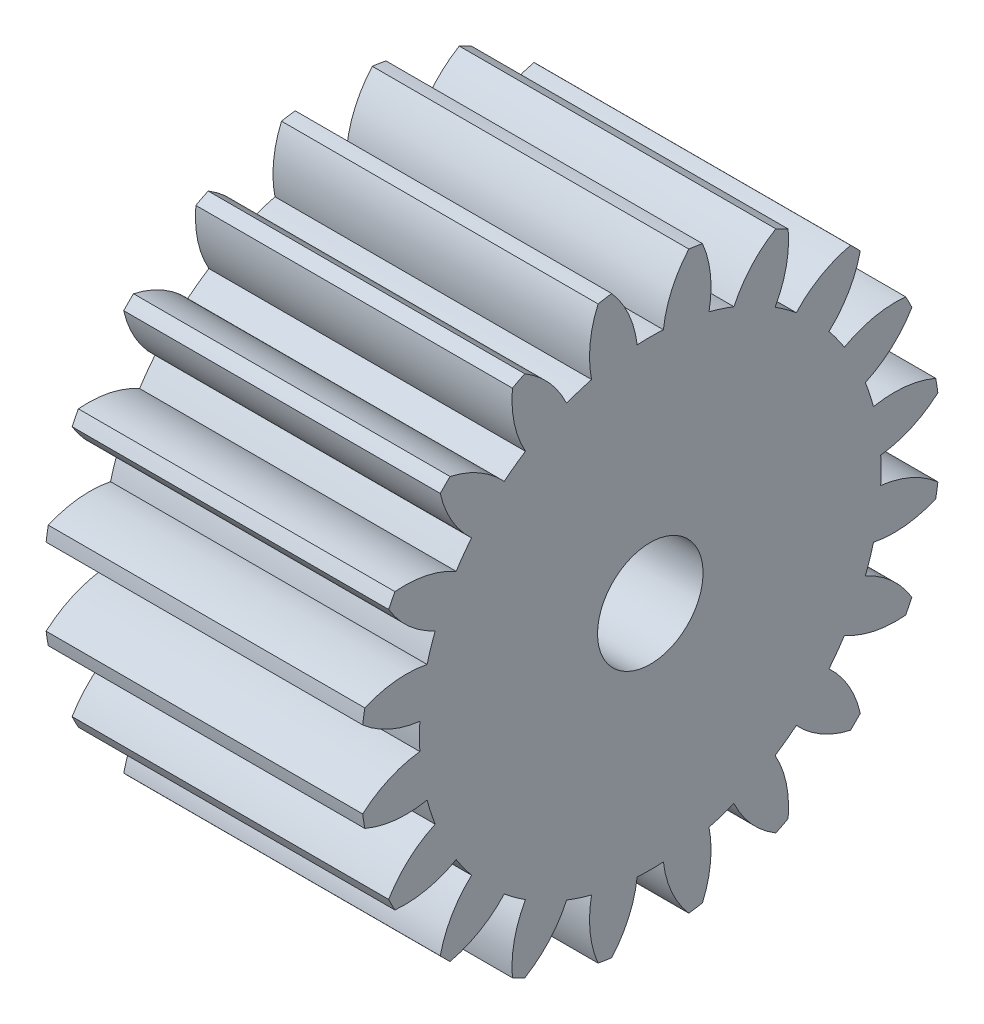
ISO-10303-21;
HEADER;
FILE_DESCRIPTION(('STEP AP214'),'2;1');
FILE_NAME('part.step','',(''),(''),'','','');
FILE_SCHEMA(('AUTOMOTIVE_DESIGN { 1 0 10303 214 1 1 1 1 }'));
ENDSEC;
DATA;
#1=APPLICATION_CONTEXT('core data for automotive mechanical design processes');
#2=APPLICATION_PROTOCOL_DEFINITION('international standard','automotive_design',2000,#1);
#3=PRODUCT_CONTEXT('',#1,'mechanical');
#4=PRODUCT('Part','Part','',(#3));
#5=PRODUCT_RELATED_PRODUCT_CATEGORY('part','',(#4));
#6=PRODUCT_DEFINITION_FORMATION('','',#4);
#7=PRODUCT_DEFINITION_CONTEXT('part definition',#1,'design');
#8=PRODUCT_DEFINITION('design','',#6,#7);
#9=PRODUCT_DEFINITION_SHAPE('','',#8);
#10=(LENGTH_UNIT() NAMED_UNIT(*) SI_UNIT(.MILLI.,.METRE.));
#11=(NAMED_UNIT(*) PLANE_ANGLE_UNIT() SI_UNIT($,.RADIAN.));
#12=(NAMED_UNIT(*) SI_UNIT($,.STERADIAN.) SOLID_ANGLE_UNIT());
#13=UNCERTAINTY_MEASURE_WITH_UNIT(LENGTH_MEASURE(1.E-05),#10,'distance_accuracy_value','');
#14=(GEOMETRIC_REPRESENTATION_CONTEXT(3) GLOBAL_UNCERTAINTY_ASSIGNED_CONTEXT((#13)) GLOBAL_UNIT_ASSIGNED_CONTEXT((#10,
#11,#12)) REPRESENTATION_CONTEXT('',''));
#15=CARTESIAN_POINT('',(0.,0.,0.));
#16=DIRECTION('',(0.,0.,1.));
#17=DIRECTION('',(1.,0.,0.));
#18=AXIS2_PLACEMENT_3D('',#15,#16,#17);
#19=CARTESIAN_POINT('',(15.,0.,0.));
#20=DIRECTION('',(-1.,0.,0.));
#21=DIRECTION('',(0.,0.,1.));
#22=AXIS2_PLACEMENT_3D('',#19,#20,#21);
#23=PLANE('',#22);
#24=CARTESIAN_POINT('',(15.,0.,0.));
#25=DIRECTION('',(-1.,0.,0.));
#26=DIRECTION('',(0.,0.,1.));
#27=AXIS2_PLACEMENT_3D('',#24,#25,#26);
#28=CIRCLE('',#27,2.5);
#29=CARTESIAN_POINT('',(15.,0.,2.5));
#30=VERTEX_POINT('',#29);
#31=EDGE_CURVE('E881',#30,#30,#28,.F.);
#32=ORIENTED_EDGE('',*,*,#31,.F.);
#33=EDGE_LOOP('',(#32));
#34=FACE_BOUND('',#33,.T.);
#35=CARTESIAN_POINT('',(15.,5.58661163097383,10.3325695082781));
#36=DIRECTION('',(-1.,0.,0.));
#37=DIRECTION('',(0.,1.,0.));
#38=AXIS2_PLACEMENT_3D('',#35,#36,#37);
#39=CIRCLE('',#38,5.);
#40=CARTESIAN_POINT('',(15.,0.621102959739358,10.9188489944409));
#41=VERTEX_POINT('',#40);
#42=CARTESIAN_POINT('',(15.,1.82641339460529,13.6281588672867));
#43=VERTEX_POINT('',#42);
#44=EDGE_CURVE('E581',#41,#43,#39,.T.);
#45=ORIENTED_EDGE('',*,*,#44,.F.);
#46=CARTESIAN_POINT('',(15.,0.,0.));
#47=DIRECTION('',(-1.,0.,0.));
#48=DIRECTION('',(0.,1.,0.));
#49=AXIS2_PLACEMENT_3D('',#46,#47,#48);
#50=CIRCLE('',#49,10.9365);
#51=CARTESIAN_POINT('',(15.,-0.621102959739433,10.9188489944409));
#52=VERTEX_POINT('',#51);
#53=EDGE_CURVE('E588',#52,#41,#50,.T.);
#54=ORIENTED_EDGE('',*,*,#53,.F.);
#55=CARTESIAN_POINT('',(15.,-5.5866116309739,10.3325695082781));
#56=DIRECTION('',(-1.,0.,0.));
#57=DIRECTION('',(0.,1.,0.));
#58=AXIS2_PLACEMENT_3D('',#55,#56,#57);
#59=CIRCLE('',#58,5.);
#60=CARTESIAN_POINT('',(15.,-1.82641339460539,13.6281588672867));
#61=VERTEX_POINT('',#60);
#62=EDGE_CURVE('E584',#61,#52,#59,.T.);
#63=ORIENTED_EDGE('',*,*,#62,.F.);
#64=CARTESIAN_POINT('',(15.,0.,0.));
#65=DIRECTION('',(-1.,0.,0.));
#66=DIRECTION('',(0.,0.,1.));
#67=AXIS2_PLACEMENT_3D('',#64,#65,#66);
#68=CIRCLE('',#67,13.75);
#69=CARTESIAN_POINT('',(15.,-2.47431033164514,13.5255420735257));
#70=VERTEX_POINT('',#69);
#71=EDGE_CURVE('E1346',#70,#61,#68,.T.);
#72=ORIENTED_EDGE('',*,*,#71,.F.);
#73=CARTESIAN_POINT('',(15.,2.12024382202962,11.5532154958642));
#74=DIRECTION('',(-1.,0.,0.));
#75=DIRECTION('',(0.,0.951056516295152,0.309016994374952));
#76=AXIS2_PLACEMENT_3D('',#73,#74,#75);
#77=CIRCLE('',#76,5.);
#78=CARTESIAN_POINT('',(15.,-2.78340588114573,10.5763738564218));
#79=VERTEX_POINT('',#78);
#80=EDGE_CURVE('E748',#79,#70,#77,.T.);
#81=ORIENTED_EDGE('',*,*,#80,.F.);
#82=CARTESIAN_POINT('',(15.,0.,0.));
#83=DIRECTION('',(-1.,0.,0.));
#84=DIRECTION('',(0.,0.951056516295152,0.309016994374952));
#85=AXIS2_PLACEMENT_3D('',#82,#83,#84);
#86=CIRCLE('',#85,10.9365);
#87=CARTESIAN_POINT('',(15.,-3.96481391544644,10.1925111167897));
#88=VERTEX_POINT('',#87);
#89=EDGE_CURVE('E755',#88,#79,#86,.T.);
#90=ORIENTED_EDGE('',*,*,#89,.F.);
#91=CARTESIAN_POINT('',(15.,-8.50612296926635,8.10049962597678));
#92=DIRECTION('',(-1.,0.,0.));
#93=DIRECTION('',(0.,0.951056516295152,0.309016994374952));
#94=AXIS2_PLACEMENT_3D('',#91,#92,#93);
#95=CIRCLE('',#94,5.);
#96=CARTESIAN_POINT('',(15.,-5.94835505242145,12.3967565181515));
#97=VERTEX_POINT('',#96);
#98=EDGE_CURVE('E751',#97,#88,#95,.T.);
#99=ORIENTED_EDGE('',*,*,#98,.F.);
#100=CARTESIAN_POINT('',(15.,-6.53283132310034,12.098950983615));
#101=VERTEX_POINT('',#100);
#102=EDGE_CURVE('E1324',#101,#97,#68,.T.);
#103=ORIENTED_EDGE('',*,*,#102,.F.);
#104=CARTESIAN_POINT('',(15.,-1.55366822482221,11.6429522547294));
#105=DIRECTION('',(-1.,0.,0.));
#106=DIRECTION('',(0.,0.809016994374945,0.587785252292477));
#107=AXIS2_PLACEMENT_3D('',#104,#105,#106);
#108=CIRCLE('',#107,5.);
#109=CARTESIAN_POINT('',(15.,-5.91545556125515,9.19860955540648));
#110=VERTEX_POINT('',#109);
#111=EDGE_CURVE('E724',#110,#101,#108,.T.);
#112=ORIENTED_EDGE('',*,*,#111,.F.);
#113=CARTESIAN_POINT('',(15.,0.,0.));
#114=DIRECTION('',(-1.,0.,0.));
#115=DIRECTION('',(0.,0.809016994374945,0.587785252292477));
#116=AXIS2_PLACEMENT_3D('',#113,#114,#115);
#117=CIRCLE('',#116,10.9365);
#118=CARTESIAN_POINT('',(15.,-6.92042126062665,8.46845923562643));
#119=VERTEX_POINT('',#118);
#120=EDGE_CURVE('E731',#119,#110,#117,.T.);
#121=ORIENTED_EDGE('',*,*,#120,.F.);
#122=CARTESIAN_POINT('',(15.,-10.5929957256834,5.07549640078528));
#123=DIRECTION('',(-1.,0.,0.));
#124=DIRECTION('',(0.,0.809016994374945,0.587785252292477));
#125=AXIS2_PLACEMENT_3D('',#122,#123,#124);
#126=CIRCLE('',#125,5.);
#127=CARTESIAN_POINT('',(15.,-9.48803027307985,9.95187326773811));
#128=VERTEX_POINT('',#127);
#129=EDGE_CURVE('E727',#128,#119,#126,.T.);
#130=ORIENTED_EDGE('',*,*,#129,.F.);
#131=CARTESIAN_POINT('',(15.,-9.95187326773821,9.48803027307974));
#132=VERTEX_POINT('',#131);
#133=EDGE_CURVE('E1453',#132,#128,#68,.T.);
#134=ORIENTED_EDGE('',*,*,#133,.F.);
#135=CARTESIAN_POINT('',(15.,-5.07549640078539,10.5929957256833));
#136=DIRECTION('',(-1.,0.,0.));
#137=DIRECTION('',(0.,0.587785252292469,0.809016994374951));
#138=AXIS2_PLACEMENT_3D('',#135,#136,#137);
#139=CIRCLE('',#138,5.);
#140=CARTESIAN_POINT('',(15.,-8.46845923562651,6.92042126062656));
#141=VERTEX_POINT('',#140);
#142=EDGE_CURVE('E700',#141,#132,#139,.T.);
#143=ORIENTED_EDGE('',*,*,#142,.F.);
#144=CARTESIAN_POINT('',(15.,0.,0.));
#145=DIRECTION('',(-1.,0.,0.));
#146=DIRECTION('',(0.,0.587785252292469,0.809016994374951));
#147=AXIS2_PLACEMENT_3D('',#144,#145,#146);
#148=CIRCLE('',#147,10.9365);
#149=CARTESIAN_POINT('',(15.,-9.19860955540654,5.91545556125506));
#150=VERTEX_POINT('',#149);
#151=EDGE_CURVE('E707',#150,#141,#148,.T.);
#152=ORIENTED_EDGE('',*,*,#151,.F.);
#153=CARTESIAN_POINT('',(15.,-11.6429522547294,1.55366822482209));
#154=DIRECTION('',(-1.,0.,0.));
#155=DIRECTION('',(0.,0.587785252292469,0.809016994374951));
#156=AXIS2_PLACEMENT_3D('',#153,#154,#155);
#157=CIRCLE('',#156,5.);
#158=CARTESIAN_POINT('',(15.,-12.0989509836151,6.53283132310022));
#159=VERTEX_POINT('',#158);
#160=EDGE_CURVE('E703',#159,#150,#157,.T.);
#161=ORIENTED_EDGE('',*,*,#160,.F.);
#162=CARTESIAN_POINT('',(15.,-12.3967565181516,5.94835505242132));
#163=VERTEX_POINT('',#162);
#164=EDGE_CURVE('E1446',#163,#159,#68,.T.);
#165=ORIENTED_EDGE('',*,*,#164,.F.);
#166=CARTESIAN_POINT('',(15.,-8.10049962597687,8.50612296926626));
#167=DIRECTION('',(-1.,0.,0.));
#168=DIRECTION('',(0.,0.309016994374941,0.951056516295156));
#169=AXIS2_PLACEMENT_3D('',#166,#167,#168);
#170=CIRCLE('',#169,5.);
#171=CARTESIAN_POINT('',(15.,-10.1925111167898,3.96481391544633));
#172=VERTEX_POINT('',#171);
#173=EDGE_CURVE('E650',#172,#163,#170,.T.);
#174=ORIENTED_EDGE('',*,*,#173,.F.);
#175=CARTESIAN_POINT('',(15.,0.,0.));
#176=DIRECTION('',(-1.,0.,0.));
#177=DIRECTION('',(0.,0.309016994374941,0.951056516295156));
#178=AXIS2_PLACEMENT_3D('',#175,#176,#177);
#179=CIRCLE('',#178,10.9365);
#180=CARTESIAN_POINT('',(15.,-10.5763738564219,2.78340588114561));
#181=VERTEX_POINT('',#180);
#182=EDGE_CURVE('E657',#181,#172,#179,.T.);
#183=ORIENTED_EDGE('',*,*,#182,.F.);
#184=CARTESIAN_POINT('',(15.,-11.5532154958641,-2.12024382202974));
#185=DIRECTION('',(-1.,0.,0.));
#186=DIRECTION('',(0.,0.309016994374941,0.951056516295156));
#187=AXIS2_PLACEMENT_3D('',#184,#185,#186);
#188=CIRCLE('',#187,5.);
#189=CARTESIAN_POINT('',(15.,-13.5255420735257,2.47431033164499));
#190=VERTEX_POINT('',#189);
#191=EDGE_CURVE('E653',#190,#181,#188,.T.);
#192=ORIENTED_EDGE('',*,*,#191,.F.);
#193=CARTESIAN_POINT('',(15.,-13.6281588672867,1.82641339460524));
#194=VERTEX_POINT('',#193);
#195=EDGE_CURVE('E1439',#194,#190,#68,.T.);
#196=ORIENTED_EDGE('',*,*,#195,.F.);
#197=CARTESIAN_POINT('',(15.,-10.3325695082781,5.58661163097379));
#198=DIRECTION('',(-1.,0.,0.));
#199=DIRECTION('',(0.,0.,1.));
#200=AXIS2_PLACEMENT_3D('',#197,#198,#199);
#201=CIRCLE('',#200,5.);
#202=CARTESIAN_POINT('',(15.,-10.9188489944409,0.62110295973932));
#203=VERTEX_POINT('',#202);
#204=EDGE_CURVE('E676',#203,#194,#201,.T.);
#205=ORIENTED_EDGE('',*,*,#204,.F.);
#206=CARTESIAN_POINT('',(15.,0.,0.));
#207=DIRECTION('',(-1.,0.,0.));
#208=DIRECTION('',(0.,0.,1.));
#209=AXIS2_PLACEMENT_3D('',#206,#207,#208);
#210=CIRCLE('',#209,10.9365);
#211=CARTESIAN_POINT('',(15.,-10.9188489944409,-0.621102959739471));
#212=VERTEX_POINT('',#211);
#213=EDGE_CURVE('E683',#212,#203,#210,.T.);
#214=ORIENTED_EDGE('',*,*,#213,.F.);
#215=CARTESIAN_POINT('',(15.,-10.332569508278,-5.58661163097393));
#216=DIRECTION('',(-1.,0.,0.));
#217=DIRECTION('',(0.,0.,1.));
#218=AXIS2_PLACEMENT_3D('',#215,#216,#217);
#219=CIRCLE('',#218,5.);
#220=CARTESIAN_POINT('',(15.,-13.6281588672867,-1.82641339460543));
#221=VERTEX_POINT('',#220);
#222=EDGE_CURVE('E679',#221,#212,#219,.T.);
#223=ORIENTED_EDGE('',*,*,#222,.F.);
#224=CARTESIAN_POINT('',(15.,-13.5255420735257,-2.47431033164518));
#225=VERTEX_POINT('',#224);
#226=EDGE_CURVE('E1432',#225,#221,#68,.T.);
#227=ORIENTED_EDGE('',*,*,#226,.F.);
#228=CARTESIAN_POINT('',(15.,-11.5532154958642,2.12024382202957));
#229=DIRECTION('',(-1.,0.,0.));
#230=DIRECTION('',(0.,-0.309016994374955,0.951056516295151));
#231=AXIS2_PLACEMENT_3D('',#228,#229,#230);
#232=CIRCLE('',#231,5.);
#233=CARTESIAN_POINT('',(15.,-10.5763738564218,-2.78340588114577));
#234=VERTEX_POINT('',#233);
#235=EDGE_CURVE('E844',#234,#225,#232,.T.);
#236=ORIENTED_EDGE('',*,*,#235,.F.);
#237=CARTESIAN_POINT('',(15.,0.,0.));
#238=DIRECTION('',(-1.,0.,0.));
#239=DIRECTION('',(0.,-0.309016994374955,0.951056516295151));
#240=AXIS2_PLACEMENT_3D('',#237,#238,#239);
#241=CIRCLE('',#240,10.9365);
#242=CARTESIAN_POINT('',(15.,-10.1925111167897,-3.96481391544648));
#243=VERTEX_POINT('',#242);
#244=EDGE_CURVE('E851',#243,#234,#241,.T.);
#245=ORIENTED_EDGE('',*,*,#244,.F.);
#246=CARTESIAN_POINT('',(15.,-8.10049962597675,-8.50612296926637));
#247=DIRECTION('',(-1.,0.,0.));
#248=DIRECTION('',(0.,-0.309016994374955,0.951056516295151));
#249=AXIS2_PLACEMENT_3D('',#246,#247,#248);
#250=CIRCLE('',#249,5.);
#251=CARTESIAN_POINT('',(15.,-12.3967565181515,-5.94835505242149));
#252=VERTEX_POINT('',#251);
#253=EDGE_CURVE('E847',#252,#243,#250,.T.);
#254=ORIENTED_EDGE('',*,*,#253,.F.);
#255=CARTESIAN_POINT('',(15.,-12.098950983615,-6.53283132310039));
#256=VERTEX_POINT('',#255);
#257=EDGE_CURVE('E1425',#256,#252,#68,.T.);
#258=ORIENTED_EDGE('',*,*,#257,.F.);
#259=CARTESIAN_POINT('',(15.,-11.6429522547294,-1.55366822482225));
#260=DIRECTION('',(-1.,0.,0.));
#261=DIRECTION('',(0.,-0.58778525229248,0.809016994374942));
#262=AXIS2_PLACEMENT_3D('',#259,#260,#261);
#263=CIRCLE('',#262,5.);
#264=CARTESIAN_POINT('',(15.,-9.19860955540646,-5.91545556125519));
#265=VERTEX_POINT('',#264);
#266=EDGE_CURVE('E820',#265,#256,#263,.T.);
#267=ORIENTED_EDGE('',*,*,#266,.F.);
#268=CARTESIAN_POINT('',(15.,0.,0.));
#269=DIRECTION('',(-1.,0.,0.));
#270=DIRECTION('',(0.,-0.58778525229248,0.809016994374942));
#271=AXIS2_PLACEMENT_3D('',#268,#269,#270);
#272=CIRCLE('',#271,10.9365);
#273=CARTESIAN_POINT('',(15.,-8.4684592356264,-6.92042126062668));
#274=VERTEX_POINT('',#273);
#275=EDGE_CURVE('E827',#274,#265,#272,.T.);
#276=ORIENTED_EDGE('',*,*,#275,.F.);
#277=CARTESIAN_POINT('',(15.,-5.07549640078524,-10.5929957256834));
#278=DIRECTION('',(-1.,0.,0.));
#279=DIRECTION('',(0.,-0.58778525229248,0.809016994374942));
#280=AXIS2_PLACEMENT_3D('',#277,#278,#279);
#281=CIRCLE('',#280,5.);
#282=CARTESIAN_POINT('',(15.,-9.95187326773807,-9.48803027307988));
#283=VERTEX_POINT('',#282);
#284=EDGE_CURVE('E823',#283,#274,#281,.T.);
#285=ORIENTED_EDGE('',*,*,#284,.F.);
#286=CARTESIAN_POINT('',(15.,-9.4880302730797,-9.95187326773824));
#287=VERTEX_POINT('',#286);
#288=EDGE_CURVE('E1418',#287,#283,#68,.T.);
#289=ORIENTED_EDGE('',*,*,#288,.F.);
#290=CARTESIAN_POINT('',(15.,-10.5929957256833,-5.07549640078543));
#291=DIRECTION('',(-1.,0.,0.));
#292=DIRECTION('',(0.,-0.809016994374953,0.587785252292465));
#293=AXIS2_PLACEMENT_3D('',#290,#291,#292);
#294=CIRCLE('',#293,5.);
#295=CARTESIAN_POINT('',(15.,-6.92042126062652,-8.46845923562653));
#296=VERTEX_POINT('',#295);
#297=EDGE_CURVE('E796',#296,#287,#294,.T.);
#298=ORIENTED_EDGE('',*,*,#297,.F.);
#299=CARTESIAN_POINT('',(15.,0.,0.));
#300=DIRECTION('',(-1.,0.,0.));
#301=DIRECTION('',(0.,-0.809016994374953,0.587785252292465));
#302=AXIS2_PLACEMENT_3D('',#299,#300,#301);
#303=CIRCLE('',#302,10.9365);
#304=CARTESIAN_POINT('',(15.,-5.91545556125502,-9.19860955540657));
#305=VERTEX_POINT('',#304);
#306=EDGE_CURVE('E803',#305,#296,#303,.T.);
#307=ORIENTED_EDGE('',*,*,#306,.F.);
#308=CARTESIAN_POINT('',(15.,-1.55366822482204,-11.6429522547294));
#309=DIRECTION('',(-1.,0.,0.));
#310=DIRECTION('',(0.,-0.809016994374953,0.587785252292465));
#311=AXIS2_PLACEMENT_3D('',#308,#309,#310);
#312=CIRCLE('',#311,5.);
#313=CARTESIAN_POINT('',(15.,-6.53283132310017,-12.0989509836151));
#314=VERTEX_POINT('',#313);
#315=EDGE_CURVE('E799',#314,#305,#312,.T.);
#316=ORIENTED_EDGE('',*,*,#315,.F.);
#317=CARTESIAN_POINT('',(15.,-5.94835505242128,-12.3967565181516));
#318=VERTEX_POINT('',#317);
#319=EDGE_CURVE('E1411',#318,#314,#68,.T.);
#320=ORIENTED_EDGE('',*,*,#319,.F.);
#321=CARTESIAN_POINT('',(15.,-8.50612296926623,-8.1004996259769));
#322=DIRECTION('',(-1.,0.,0.));
#323=DIRECTION('',(0.,-0.951056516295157,0.309016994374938));
#324=AXIS2_PLACEMENT_3D('',#321,#322,#323);
#325=CIRCLE('',#324,5.);
#326=CARTESIAN_POINT('',(15.,-3.9648139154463,-10.1925111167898));
#327=VERTEX_POINT('',#326);
#328=EDGE_CURVE('E770',#327,#318,#325,.T.);
#329=ORIENTED_EDGE('',*,*,#328,.F.);
#330=CARTESIAN_POINT('',(15.,0.,0.));
#331=DIRECTION('',(-1.,0.,0.));
#332=DIRECTION('',(0.,-0.951056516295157,0.309016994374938));
#333=AXIS2_PLACEMENT_3D('',#330,#331,#332);
#334=CIRCLE('',#333,10.9365);
#335=CARTESIAN_POINT('',(15.,-2.78340588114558,-10.5763738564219));
#336=VERTEX_POINT('',#335);
#337=EDGE_CURVE('E777',#336,#327,#334,.T.);
#338=ORIENTED_EDGE('',*,*,#337,.F.);
#339=CARTESIAN_POINT('',(15.,2.12024382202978,-11.5532154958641));
#340=DIRECTION('',(-1.,0.,0.));
#341=DIRECTION('',(0.,-0.951056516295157,0.309016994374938));
#342=AXIS2_PLACEMENT_3D('',#339,#340,#341);
#343=CIRCLE('',#342,5.);
#344=CARTESIAN_POINT('',(15.,-2.47431033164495,-13.5255420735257));
#345=VERTEX_POINT('',#344);
#346=EDGE_CURVE('E773',#345,#336,#343,.T.);
#347=ORIENTED_EDGE('',*,*,#346,.F.);
#348=CARTESIAN_POINT('',(15.,-1.8264133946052,-13.6281588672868));
#349=VERTEX_POINT('',#348);
#350=EDGE_CURVE('E1404',#349,#345,#68,.T.);
#351=ORIENTED_EDGE('',*,*,#350,.F.);
#352=CARTESIAN_POINT('',(15.,-5.58661163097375,-10.3325695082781));
#353=DIRECTION('',(-1.,0.,0.));
#354=DIRECTION('',(0.,-1.,0.));
#355=AXIS2_PLACEMENT_3D('',#352,#353,#354);
#356=CIRCLE('',#355,5.);
#357=CARTESIAN_POINT('',(15.,-0.621102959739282,-10.9188489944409));
#358=VERTEX_POINT('',#357);
#359=EDGE_CURVE('E940',#358,#349,#356,.T.);
#360=ORIENTED_EDGE('',*,*,#359,.F.);
#361=CARTESIAN_POINT('',(15.,0.,0.));
#362=DIRECTION('',(-1.,0.,0.));
#363=DIRECTION('',(0.,-1.,0.));
#364=AXIS2_PLACEMENT_3D('',#361,#362,#363);
#365=CIRCLE('',#364,10.9365);
#366=CARTESIAN_POINT('',(15.,0.621102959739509,-10.9188489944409));
#367=VERTEX_POINT('',#366);
#368=EDGE_CURVE('E947',#367,#358,#365,.T.);
#369=ORIENTED_EDGE('',*,*,#368,.F.);
#370=CARTESIAN_POINT('',(15.,5.58661163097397,-10.332569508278));
#371=DIRECTION('',(-1.,0.,0.));
#372=DIRECTION('',(0.,-1.,0.));
#373=AXIS2_PLACEMENT_3D('',#370,#371,#372);
#374=CIRCLE('',#373,5.);
#375=CARTESIAN_POINT('',(15.,1.82641339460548,-13.6281588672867));
#376=VERTEX_POINT('',#375);
#377=EDGE_CURVE('E943',#376,#367,#374,.T.);
#378=ORIENTED_EDGE('',*,*,#377,.F.);
#379=CARTESIAN_POINT('',(15.,2.47431033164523,-13.5255420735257));
#380=VERTEX_POINT('',#379);
#381=EDGE_CURVE('E1397',#380,#376,#68,.T.);
#382=ORIENTED_EDGE('',*,*,#381,.F.);
#383=CARTESIAN_POINT('',(15.,-2.12024382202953,-11.5532154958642));
#384=DIRECTION('',(-1.,0.,0.));
#385=DIRECTION('',(0.,-0.95105651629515,-0.309016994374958));
#386=AXIS2_PLACEMENT_3D('',#383,#384,#385);
#387=CIRCLE('',#386,5.);
#388=CARTESIAN_POINT('',(15.,2.7834058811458,-10.5763738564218));
#389=VERTEX_POINT('',#388);
#390=EDGE_CURVE('E964',#389,#380,#387,.T.);
#391=ORIENTED_EDGE('',*,*,#390,.F.);
#392=CARTESIAN_POINT('',(15.,0.,0.));
#393=DIRECTION('',(-1.,0.,0.));
#394=DIRECTION('',(0.,-0.95105651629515,-0.309016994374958));
#395=AXIS2_PLACEMENT_3D('',#392,#393,#394);
#396=CIRCLE('',#395,10.9365);
#397=CARTESIAN_POINT('',(15.,3.96481391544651,-10.1925111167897));
#398=VERTEX_POINT('',#397);
#399=EDGE_CURVE('E971',#398,#389,#396,.T.);
#400=ORIENTED_EDGE('',*,*,#399,.F.);
#401=CARTESIAN_POINT('',(15.,8.5061229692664,-8.10049962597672));
#402=DIRECTION('',(-1.,0.,0.));
#403=DIRECTION('',(0.,-0.95105651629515,-0.309016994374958));
#404=AXIS2_PLACEMENT_3D('',#401,#402,#403);
#405=CIRCLE('',#404,5.);
#406=CARTESIAN_POINT('',(15.,5.94835505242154,-12.3967565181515));
#407=VERTEX_POINT('',#406);
#408=EDGE_CURVE('E967',#407,#398,#405,.T.);
#409=ORIENTED_EDGE('',*,*,#408,.F.);
#410=CARTESIAN_POINT('',(15.,6.53283132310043,-12.098950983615));
#411=VERTEX_POINT('',#410);
#412=EDGE_CURVE('E1390',#411,#407,#68,.T.);
#413=ORIENTED_EDGE('',*,*,#412,.F.);
#414=CARTESIAN_POINT('',(15.,1.55366822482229,-11.6429522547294));
#415=DIRECTION('',(-1.,0.,0.));
#416=DIRECTION('',(0.,-0.80901699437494,-0.587785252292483));
#417=AXIS2_PLACEMENT_3D('',#414,#415,#416);
#418=CIRCLE('',#417,5.);
#419=CARTESIAN_POINT('',(15.,5.91545556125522,-9.19860955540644));
#420=VERTEX_POINT('',#419);
#421=EDGE_CURVE('E916',#420,#411,#418,.T.);
#422=ORIENTED_EDGE('',*,*,#421,.F.);
#423=CARTESIAN_POINT('',(15.,0.,0.));
#424=DIRECTION('',(-1.,0.,0.));
#425=DIRECTION('',(0.,-0.80901699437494,-0.587785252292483));
#426=AXIS2_PLACEMENT_3D('',#423,#424,#425);
#427=CIRCLE('',#426,10.9365);
#428=CARTESIAN_POINT('',(15.,6.92042126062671,-8.46845923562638));
#429=VERTEX_POINT('',#428);
#430=EDGE_CURVE('E923',#429,#420,#427,.T.);
#431=ORIENTED_EDGE('',*,*,#430,.F.);
#432=CARTESIAN_POINT('',(15.,10.5929957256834,-5.0754964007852));
#433=DIRECTION('',(-1.,0.,0.));
#434=DIRECTION('',(0.,-0.80901699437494,-0.587785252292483));
#435=AXIS2_PLACEMENT_3D('',#432,#433,#434);
#436=CIRCLE('',#435,5.);
#437=CARTESIAN_POINT('',(15.,9.48803027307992,-9.95187326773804));
#438=VERTEX_POINT('',#437);
#439=EDGE_CURVE('E919',#438,#429,#436,.T.);
#440=ORIENTED_EDGE('',*,*,#439,.F.);
#441=CARTESIAN_POINT('',(15.,9.95187326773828,-9.48803027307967));
#442=VERTEX_POINT('',#441);
#443=EDGE_CURVE('E1383',#442,#438,#68,.T.);
#444=ORIENTED_EDGE('',*,*,#443,.F.);
#445=CARTESIAN_POINT('',(15.,5.07549640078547,-10.5929957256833));
#446=DIRECTION('',(-1.,0.,0.));
#447=DIRECTION('',(0.,-0.587785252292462,-0.809016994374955));
#448=AXIS2_PLACEMENT_3D('',#445,#446,#447);
#449=CIRCLE('',#448,5.);
#450=CARTESIAN_POINT('',(15.,8.46845923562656,-6.9204212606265));
#451=VERTEX_POINT('',#450);
#452=EDGE_CURVE('E892',#451,#442,#449,.T.);
#453=ORIENTED_EDGE('',*,*,#452,.F.);
#454=CARTESIAN_POINT('',(15.,0.,0.));
#455=DIRECTION('',(-1.,0.,0.));
#456=DIRECTION('',(0.,-0.587785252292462,-0.809016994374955));
#457=AXIS2_PLACEMENT_3D('',#454,#455,#456);
#458=CIRCLE('',#457,10.9365);
#459=CARTESIAN_POINT('',(15.,9.19860955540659,-5.91545556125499));
#460=VERTEX_POINT('',#459);
#461=EDGE_CURVE('E899',#460,#451,#458,.T.);
#462=ORIENTED_EDGE('',*,*,#461,.F.);
#463=CARTESIAN_POINT('',(15.,11.6429522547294,-1.553668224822));
#464=DIRECTION('',(-1.,0.,0.));
#465=DIRECTION('',(0.,-0.587785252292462,-0.809016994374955));
#466=AXIS2_PLACEMENT_3D('',#463,#464,#465);
#467=CIRCLE('',#466,5.);
#468=CARTESIAN_POINT('',(15.,12.0989509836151,-6.53283132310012));
#469=VERTEX_POINT('',#468);
#470=EDGE_CURVE('E895',#469,#460,#467,.T.);
#471=ORIENTED_EDGE('',*,*,#470,.F.);
#472=CARTESIAN_POINT('',(15.,12.3967565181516,-5.94835505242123));
#473=VERTEX_POINT('',#472);
#474=EDGE_CURVE('E1167',#473,#469,#68,.T.);
#475=ORIENTED_EDGE('',*,*,#474,.F.);
#476=CARTESIAN_POINT('',(15.,8.10049962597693,-8.5061229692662));
#477=DIRECTION('',(-1.,0.,0.));
#478=DIRECTION('',(0.,-0.309016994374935,-0.951056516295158));
#479=AXIS2_PLACEMENT_3D('',#476,#477,#478);
#480=CIRCLE('',#479,5.);
#481=CARTESIAN_POINT('',(15.,10.1925111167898,-3.96481391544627));
#482=VERTEX_POINT('',#481);
#483=EDGE_CURVE('E866',#482,#473,#480,.T.);
#484=ORIENTED_EDGE('',*,*,#483,.F.);
#485=CARTESIAN_POINT('',(15.,0.,0.));
#486=DIRECTION('',(-1.,0.,0.));
#487=DIRECTION('',(0.,-0.309016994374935,-0.951056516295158));
#488=AXIS2_PLACEMENT_3D('',#485,#486,#487);
#489=CIRCLE('',#488,10.9365);
#490=CARTESIAN_POINT('',(15.,10.5763738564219,-2.78340588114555));
#491=VERTEX_POINT('',#490);
#492=EDGE_CURVE('E873',#491,#482,#489,.T.);
#493=ORIENTED_EDGE('',*,*,#492,.F.);
#494=CARTESIAN_POINT('',(15.,11.5532154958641,2.12024382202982));
#495=DIRECTION('',(-1.,0.,0.));
#496=DIRECTION('',(0.,-0.309016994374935,-0.951056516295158));
#497=AXIS2_PLACEMENT_3D('',#494,#495,#496);
#498=CIRCLE('',#497,5.);
#499=CARTESIAN_POINT('',(15.,13.5255420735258,-2.4743103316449));
#500=VERTEX_POINT('',#499);
#501=EDGE_CURVE('E869',#500,#491,#498,.T.);
#502=ORIENTED_EDGE('',*,*,#501,.F.);
#503=CARTESIAN_POINT('',(15.,13.6281588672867,-1.82641339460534));
#504=VERTEX_POINT('',#503);
#505=EDGE_CURVE('E1162',#504,#500,#68,.T.);
#506=ORIENTED_EDGE('',*,*,#505,.F.);
#507=CARTESIAN_POINT('',(15.,10.3325695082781,-5.58661163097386));
#508=DIRECTION('',(-1.,0.,0.));
#509=DIRECTION('',(0.,0.,-1.));
#510=AXIS2_PLACEMENT_3D('',#507,#508,#509);
#511=CIRCLE('',#510,5.);
#512=CARTESIAN_POINT('',(15.,10.9188489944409,-0.621102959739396));
#513=VERTEX_POINT('',#512);
#514=EDGE_CURVE('E1124',#513,#504,#511,.T.);
#515=ORIENTED_EDGE('',*,*,#514,.F.);
#516=CARTESIAN_POINT('',(15.,0.,0.));
#517=DIRECTION('',(-1.,0.,0.));
#518=DIRECTION('',(0.,0.,-1.));
#519=AXIS2_PLACEMENT_3D('',#516,#517,#518);
#520=CIRCLE('',#519,10.9365);
#521=CARTESIAN_POINT('',(15.,10.9188489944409,0.621102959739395));
#522=VERTEX_POINT('',#521);
#523=EDGE_CURVE('E1131',#522,#513,#520,.T.);
#524=ORIENTED_EDGE('',*,*,#523,.F.);
#525=CARTESIAN_POINT('',(15.,10.3325695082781,5.58661163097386));
#526=DIRECTION('',(-1.,0.,0.));
#527=DIRECTION('',(0.,0.,-1.));
#528=AXIS2_PLACEMENT_3D('',#525,#526,#527);
#529=CIRCLE('',#528,5.);
#530=CARTESIAN_POINT('',(15.,13.6281588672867,1.82641339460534));
#531=VERTEX_POINT('',#530);
#532=EDGE_CURVE('E1127',#531,#522,#529,.T.);
#533=ORIENTED_EDGE('',*,*,#532,.F.);
#534=CARTESIAN_POINT('',(15.,13.5255420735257,2.47431033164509));
#535=VERTEX_POINT('',#534);
#536=EDGE_CURVE('E1159',#535,#531,#68,.T.);
#537=ORIENTED_EDGE('',*,*,#536,.F.);
#538=CARTESIAN_POINT('',(15.,11.5532154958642,-2.12024382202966));
#539=DIRECTION('',(-1.,0.,0.));
#540=DIRECTION('',(0.,0.309016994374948,-0.951056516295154));
#541=AXIS2_PLACEMENT_3D('',#538,#539,#540);
#542=CIRCLE('',#541,5.);
#543=CARTESIAN_POINT('',(15.,10.5763738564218,2.78340588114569));
#544=VERTEX_POINT('',#543);
#545=EDGE_CURVE('E1093',#544,#535,#542,.T.);
#546=ORIENTED_EDGE('',*,*,#545,.F.);
#547=CARTESIAN_POINT('',(15.,0.,0.));
#548=DIRECTION('',(-1.,0.,0.));
#549=DIRECTION('',(0.,0.309016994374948,-0.951056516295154));
#550=AXIS2_PLACEMENT_3D('',#547,#548,#549);
#551=CIRCLE('',#550,10.9365);
#552=CARTESIAN_POINT('',(15.,10.1925111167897,3.96481391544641));
#553=VERTEX_POINT('',#552);
#554=EDGE_CURVE('E1100',#553,#544,#551,.T.);
#555=ORIENTED_EDGE('',*,*,#554,.F.);
#556=CARTESIAN_POINT('',(15.,8.10049962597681,8.50612296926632));
#557=DIRECTION('',(-1.,0.,0.));
#558=DIRECTION('',(0.,0.309016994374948,-0.951056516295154));
#559=AXIS2_PLACEMENT_3D('',#556,#557,#558);
#560=CIRCLE('',#559,5.);
#561=CARTESIAN_POINT('',(15.,12.3967565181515,5.94835505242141));
#562=VERTEX_POINT('',#561);
#563=EDGE_CURVE('E1096',#562,#553,#560,.T.);
#564=ORIENTED_EDGE('',*,*,#563,.F.);
#565=CARTESIAN_POINT('',(15.,12.098950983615,6.5328313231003));
#566=VERTEX_POINT('',#565);
#567=EDGE_CURVE('E1168',#566,#562,#68,.T.);
#568=ORIENTED_EDGE('',*,*,#567,.F.);
#569=CARTESIAN_POINT('',(15.,11.6429522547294,1.55366822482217));
#570=DIRECTION('',(-1.,0.,0.));
#571=DIRECTION('',(0.,0.587785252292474,-0.809016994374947));
#572=AXIS2_PLACEMENT_3D('',#569,#570,#571);
#573=CIRCLE('',#572,5.);
#574=CARTESIAN_POINT('',(15.,9.19860955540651,5.91545556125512));
#575=VERTEX_POINT('',#574);
#576=EDGE_CURVE('E626',#575,#566,#573,.T.);
#577=ORIENTED_EDGE('',*,*,#576,.F.);
#578=CARTESIAN_POINT('',(15.,0.,0.));
#579=DIRECTION('',(-1.,0.,0.));
#580=DIRECTION('',(0.,0.587785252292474,-0.809016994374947));
#581=AXIS2_PLACEMENT_3D('',#578,#579,#580);
#582=CIRCLE('',#581,10.9365);
#583=CARTESIAN_POINT('',(15.,8.46845923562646,6.92042126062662));
#584=VERTEX_POINT('',#583);
#585=EDGE_CURVE('E633',#584,#575,#582,.T.);
#586=ORIENTED_EDGE('',*,*,#585,.F.);
#587=CARTESIAN_POINT('',(15.,5.07549640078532,10.5929957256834));
#588=DIRECTION('',(-1.,0.,0.));
#589=DIRECTION('',(0.,0.587785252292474,-0.809016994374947));
#590=AXIS2_PLACEMENT_3D('',#587,#588,#589);
#591=CIRCLE('',#590,5.);
#592=CARTESIAN_POINT('',(15.,9.95187326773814,9.48803027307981));
#593=VERTEX_POINT('',#592);
#594=EDGE_CURVE('E629',#593,#584,#591,.T.);
#595=ORIENTED_EDGE('',*,*,#594,.F.);
#596=CARTESIAN_POINT('',(15.,9.48803027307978,9.95187326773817));
#597=VERTEX_POINT('',#596);
#598=EDGE_CURVE('E1361',#597,#593,#68,.T.);
#599=ORIENTED_EDGE('',*,*,#598,.F.);
#600=CARTESIAN_POINT('',(15.,10.5929957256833,5.07549640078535));
#601=DIRECTION('',(-1.,0.,0.));
#602=DIRECTION('',(0.,0.809016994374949,-0.587785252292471));
#603=AXIS2_PLACEMENT_3D('',#600,#601,#602);
#604=CIRCLE('',#603,5.);
#605=CARTESIAN_POINT('',(15.,6.92042126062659,8.46845923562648));
#606=VERTEX_POINT('',#605);
#607=EDGE_CURVE('E602',#606,#597,#604,.T.);
#608=ORIENTED_EDGE('',*,*,#607,.F.);
#609=CARTESIAN_POINT('',(15.,0.,0.));
#610=DIRECTION('',(-1.,0.,0.));
#611=DIRECTION('',(0.,0.809016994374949,-0.587785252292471));
#612=AXIS2_PLACEMENT_3D('',#609,#610,#611);
#613=CIRCLE('',#612,10.9365);
#614=CARTESIAN_POINT('',(15.,5.91545556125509,9.19860955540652));
#615=VERTEX_POINT('',#614);
#616=EDGE_CURVE('E609',#615,#606,#613,.T.);
#617=ORIENTED_EDGE('',*,*,#616,.F.);
#618=CARTESIAN_POINT('',(15.,1.55366822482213,11.6429522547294));
#619=DIRECTION('',(-1.,0.,0.));
#620=DIRECTION('',(0.,0.809016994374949,-0.587785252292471));
#621=AXIS2_PLACEMENT_3D('',#618,#619,#620);
#622=CIRCLE('',#621,5.);
#623=CARTESIAN_POINT('',(15.,6.53283132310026,12.0989509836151));
#624=VERTEX_POINT('',#623);
#625=EDGE_CURVE('E605',#624,#615,#622,.T.);
#626=ORIENTED_EDGE('',*,*,#625,.F.);
#627=CARTESIAN_POINT('',(15.,5.94835505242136,12.3967565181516));
#628=VERTEX_POINT('',#627);
#629=EDGE_CURVE('E1357',#628,#624,#68,.T.);
#630=ORIENTED_EDGE('',*,*,#629,.F.);
#631=CARTESIAN_POINT('',(15.,8.50612296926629,8.10049962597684));
#632=DIRECTION('',(-1.,0.,0.));
#633=DIRECTION('',(0.,0.951056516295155,-0.309016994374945));
#634=AXIS2_PLACEMENT_3D('',#631,#632,#633);
#635=CIRCLE('',#634,5.);
#636=CARTESIAN_POINT('',(15.,3.96481391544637,10.1925111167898));
#637=VERTEX_POINT('',#636);
#638=EDGE_CURVE('E556',#637,#628,#635,.T.);
#639=ORIENTED_EDGE('',*,*,#638,.F.);
#640=CARTESIAN_POINT('',(15.,0.,0.));
#641=DIRECTION('',(-1.,0.,0.));
#642=DIRECTION('',(0.,0.951056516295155,-0.309016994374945));
#643=AXIS2_PLACEMENT_3D('',#640,#641,#642);
#644=CIRCLE('',#643,10.9365);
#645=CARTESIAN_POINT('',(15.,2.78340588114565,10.5763738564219));
#646=VERTEX_POINT('',#645);
#647=EDGE_CURVE('E555',#646,#637,#644,.T.);
#648=ORIENTED_EDGE('',*,*,#647,.F.);
#649=CARTESIAN_POINT('',(15.,-2.1202438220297,11.5532154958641));
#650=DIRECTION('',(-1.,0.,0.));
#651=DIRECTION('',(0.,0.951056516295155,-0.309016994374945));
#652=AXIS2_PLACEMENT_3D('',#649,#650,#651);
#653=CIRCLE('',#652,5.);
#654=CARTESIAN_POINT('',(15.,2.47431033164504,13.5255420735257));
#655=VERTEX_POINT('',#654);
#656=EDGE_CURVE('E543',#655,#646,#653,.T.);
#657=ORIENTED_EDGE('',*,*,#656,.F.);
#658=EDGE_CURVE('E1232',#43,#655,#68,.T.);
#659=ORIENTED_EDGE('',*,*,#658,.F.);
#660=EDGE_LOOP('',(#45,#54,#63,#72,#81,#90,#99,#103,#112,#121,#130,#134,#143,#152,#161,#165,
#174,#183,#192,#196,#205,#214,#223,#227,#236,#245,#254,#258,#267,#276,#285,#289,#298,#307,#316,
#320,#329,#338,#347,#351,#360,#369,#378,#382,#391,#400,#409,#413,#422,#431,#440,#444,#453,#462,
#471,#475,#484,#493,#502,#506,#515,#524,#533,#537,#546,#555,#564,#568,#577,#586,#595,#599,#608,
#617,#626,#630,#639,#648,#657,#659));
#661=FACE_BOUND('',#660,.T.);
#662=ADVANCED_FACE('F45',(#34,#661),#23,.F.);
#663=CARTESIAN_POINT('',(-10.,0.,0.));
#664=DIRECTION('',(-1.,0.,0.));
#665=DIRECTION('',(0.,0.,1.));
#666=AXIS2_PLACEMENT_3D('',#663,#664,#665);
#667=CYLINDRICAL_SURFACE('',#666,13.75);
#668=DIRECTION('',(-1.,0.,0.));
#669=VECTOR('',#668,1.);
#670=CARTESIAN_POINT('',(7.5,1.82641339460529,13.6281588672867));
#671=LINE('',#670,#669);
#672=CARTESIAN_POINT('',(0.,1.82641339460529,13.6281588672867));
#673=VERTEX_POINT('',#672);
#674=EDGE_CURVE('E1089',#43,#673,#671,.T.);
#675=ORIENTED_EDGE('',*,*,#674,.F.);
#676=ORIENTED_EDGE('',*,*,#658,.T.);
#677=DIRECTION('',(-1.,0.,0.));
#678=VECTOR('',#677,1.);
#679=CARTESIAN_POINT('',(7.5,2.47431033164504,13.5255420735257));
#680=LINE('',#679,#678);
#681=CARTESIAN_POINT('',(0.,2.47431033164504,13.5255420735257));
#682=VERTEX_POINT('',#681);
#683=EDGE_CURVE('E549',#682,#655,#680,.F.);
#684=ORIENTED_EDGE('',*,*,#683,.F.);
#685=CARTESIAN_POINT('',(0.,0.,0.));
#686=DIRECTION('',(-1.,0.,0.));
#687=DIRECTION('',(0.,0.,1.));
#688=AXIS2_PLACEMENT_3D('',#685,#686,#687);
#689=CIRCLE('',#688,13.75);
#690=EDGE_CURVE('E1231',#673,#682,#689,.T.);
#691=ORIENTED_EDGE('',*,*,#690,.F.);
#692=EDGE_LOOP('',(#675,#676,#684,#691));
#693=FACE_BOUND('',#692,.T.);
#694=ADVANCED_FACE('F1230',(#693),#667,.T.);
#695=DIRECTION('',(-1.,0.,0.));
#696=VECTOR('',#695,1.);
#697=CARTESIAN_POINT('',(7.5,-1.82641339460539,13.6281588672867));
#698=LINE('',#697,#696);
#699=CARTESIAN_POINT('',(0.,-1.82641339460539,13.6281588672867));
#700=VERTEX_POINT('',#699);
#701=EDGE_CURVE('E1086',#700,#61,#698,.F.);
#702=ORIENTED_EDGE('',*,*,#701,.F.);
#703=CARTESIAN_POINT('',(0.,-2.47431033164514,13.5255420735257));
#704=VERTEX_POINT('',#703);
#705=EDGE_CURVE('E1235',#704,#700,#689,.T.);
#706=ORIENTED_EDGE('',*,*,#705,.F.);
#707=DIRECTION('',(-1.,0.,0.));
#708=VECTOR('',#707,1.);
#709=CARTESIAN_POINT('',(7.5,-2.47431033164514,13.5255420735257));
#710=LINE('',#709,#708);
#711=EDGE_CURVE('E1048',#70,#704,#710,.T.);
#712=ORIENTED_EDGE('',*,*,#711,.F.);
#713=ORIENTED_EDGE('',*,*,#71,.T.);
#714=EDGE_LOOP('',(#702,#706,#712,#713));
#715=FACE_BOUND('',#714,.T.);
#716=ADVANCED_FACE('F1344',(#715),#667,.T.);
#717=DIRECTION('',(-1.,0.,0.));
#718=VECTOR('',#717,1.);
#719=CARTESIAN_POINT('',(7.5,5.94835505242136,12.3967565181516));
#720=LINE('',#719,#718);
#721=CARTESIAN_POINT('',(0.,5.94835505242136,12.3967565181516));
#722=VERTEX_POINT('',#721);
#723=EDGE_CURVE('E1083',#628,#722,#720,.T.);
#724=ORIENTED_EDGE('',*,*,#723,.F.);
#725=ORIENTED_EDGE('',*,*,#629,.T.);
#726=DIRECTION('',(-1.,0.,0.));
#727=VECTOR('',#726,1.);
#728=CARTESIAN_POINT('',(7.5,6.53283132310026,12.0989509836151));
#729=LINE('',#728,#727);
#730=CARTESIAN_POINT('',(0.,6.53283132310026,12.0989509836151));
#731=VERTEX_POINT('',#730);
#732=EDGE_CURVE('E1069',#731,#624,#729,.F.);
#733=ORIENTED_EDGE('',*,*,#732,.F.);
#734=EDGE_CURVE('E1236',#722,#731,#689,.T.);
#735=ORIENTED_EDGE('',*,*,#734,.F.);
#736=EDGE_LOOP('',(#724,#725,#733,#735));
#737=FACE_BOUND('',#736,.T.);
#738=ADVANCED_FACE('F1508',(#737),#667,.T.);
#739=DIRECTION('',(-1.,0.,0.));
#740=VECTOR('',#739,1.);
#741=CARTESIAN_POINT('',(7.5,12.098950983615,6.5328313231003));
#742=LINE('',#741,#740);
#743=CARTESIAN_POINT('',(0.,12.098950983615,6.5328313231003));
#744=VERTEX_POINT('',#743);
#745=EDGE_CURVE('E1078',#566,#744,#742,.T.);
#746=ORIENTED_EDGE('',*,*,#745,.F.);
#747=ORIENTED_EDGE('',*,*,#567,.T.);
#748=DIRECTION('',(-1.,0.,0.));
#749=VECTOR('',#748,1.);
#750=CARTESIAN_POINT('',(7.5,12.3967565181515,5.9483550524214));
#751=LINE('',#750,#749);
#752=CARTESIAN_POINT('',(0.,12.3967565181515,5.9483550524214));
#753=VERTEX_POINT('',#752);
#754=EDGE_CURVE('E1116',#753,#562,#751,.F.);
#755=ORIENTED_EDGE('',*,*,#754,.F.);
#756=EDGE_CURVE('E1161',#744,#753,#689,.T.);
#757=ORIENTED_EDGE('',*,*,#756,.F.);
#758=EDGE_LOOP('',(#746,#747,#755,#757));
#759=FACE_BOUND('',#758,.T.);
#760=ADVANCED_FACE('F1533',(#759),#667,.T.);
#761=DIRECTION('',(-1.,0.,0.));
#762=VECTOR('',#761,1.);
#763=CARTESIAN_POINT('',(7.5,9.95187326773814,9.48803027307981));
#764=LINE('',#763,#762);
#765=CARTESIAN_POINT('',(0.,9.95187326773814,9.48803027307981));
#766=VERTEX_POINT('',#765);
#767=EDGE_CURVE('E1075',#766,#593,#764,.F.);
#768=ORIENTED_EDGE('',*,*,#767,.F.);
#769=CARTESIAN_POINT('',(0.,9.48803027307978,9.95187326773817));
#770=VERTEX_POINT('',#769);
#771=EDGE_CURVE('E1242',#770,#766,#689,.T.);
#772=ORIENTED_EDGE('',*,*,#771,.F.);
#773=DIRECTION('',(-1.,0.,0.));
#774=VECTOR('',#773,1.);
#775=CARTESIAN_POINT('',(7.5,9.48803027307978,9.95187326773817));
#776=LINE('',#775,#774);
#777=EDGE_CURVE('E1072',#597,#770,#776,.T.);
#778=ORIENTED_EDGE('',*,*,#777,.F.);
#779=ORIENTED_EDGE('',*,*,#598,.T.);
#780=EDGE_LOOP('',(#768,#772,#778,#779));
#781=FACE_BOUND('',#780,.T.);
#782=ADVANCED_FACE('F1520',(#781),#667,.T.);
#783=DIRECTION('',(-1.,0.,0.));
#784=VECTOR('',#783,1.);
#785=CARTESIAN_POINT('',(7.5,-9.9518732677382,9.48803027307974));
#786=LINE('',#785,#784);
#787=CARTESIAN_POINT('',(0.,-9.9518732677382,9.48803027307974));
#788=VERTEX_POINT('',#787);
#789=EDGE_CURVE('E1066',#132,#788,#786,.T.);
#790=ORIENTED_EDGE('',*,*,#789,.F.);
#791=ORIENTED_EDGE('',*,*,#133,.T.);
#792=DIRECTION('',(-1.,0.,0.));
#793=VECTOR('',#792,1.);
#794=CARTESIAN_POINT('',(7.5,-9.48803027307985,9.95187326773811));
#795=LINE('',#794,#793);
#796=CARTESIAN_POINT('',(0.,-9.48803027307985,9.95187326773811));
#797=VERTEX_POINT('',#796);
#798=EDGE_CURVE('E1039',#797,#128,#795,.F.);
#799=ORIENTED_EDGE('',*,*,#798,.F.);
#800=EDGE_CURVE('E1307',#788,#797,#689,.T.);
#801=ORIENTED_EDGE('',*,*,#800,.F.);
#802=EDGE_LOOP('',(#790,#791,#799,#801));
#803=FACE_BOUND('',#802,.T.);
#804=ADVANCED_FACE('F1465',(#803),#667,.T.);
#805=DIRECTION('',(-1.,0.,0.));
#806=VECTOR('',#805,1.);
#807=CARTESIAN_POINT('',(7.5,-12.0989509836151,6.53283132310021));
#808=LINE('',#807,#806);
#809=CARTESIAN_POINT('',(0.,-12.0989509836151,6.53283132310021));
#810=VERTEX_POINT('',#809);
#811=EDGE_CURVE('E1063',#810,#159,#808,.F.);
#812=ORIENTED_EDGE('',*,*,#811,.F.);
#813=CARTESIAN_POINT('',(0.,-12.3967565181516,5.94835505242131));
#814=VERTEX_POINT('',#813);
#815=EDGE_CURVE('E1302',#814,#810,#689,.T.);
#816=ORIENTED_EDGE('',*,*,#815,.F.);
#817=DIRECTION('',(-1.,0.,0.));
#818=VECTOR('',#817,1.);
#819=CARTESIAN_POINT('',(7.5,-12.3967565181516,5.94835505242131));
#820=LINE('',#819,#818);
#821=EDGE_CURVE('E1060',#163,#814,#820,.T.);
#822=ORIENTED_EDGE('',*,*,#821,.F.);
#823=ORIENTED_EDGE('',*,*,#164,.T.);
#824=EDGE_LOOP('',(#812,#816,#822,#823));
#825=FACE_BOUND('',#824,.T.);
#826=ADVANCED_FACE('F1704',(#825),#667,.T.);
#827=DIRECTION('',(-1.,0.,0.));
#828=VECTOR('',#827,1.);
#829=CARTESIAN_POINT('',(7.5,-13.5255420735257,2.47431033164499));
#830=LINE('',#829,#828);
#831=CARTESIAN_POINT('',(0.,-13.5255420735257,2.47431033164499));
#832=VERTEX_POINT('',#831);
#833=EDGE_CURVE('E1057',#832,#190,#830,.F.);
#834=ORIENTED_EDGE('',*,*,#833,.F.);
#835=CARTESIAN_POINT('',(0.,-13.6281588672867,1.82641339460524));
#836=VERTEX_POINT('',#835);
#837=EDGE_CURVE('E1297',#836,#832,#689,.T.);
#838=ORIENTED_EDGE('',*,*,#837,.F.);
#839=DIRECTION('',(-1.,0.,0.));
#840=VECTOR('',#839,1.);
#841=CARTESIAN_POINT('',(7.5,-13.6281588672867,1.82641339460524));
#842=LINE('',#841,#840);
#843=EDGE_CURVE('E1054',#194,#836,#842,.T.);
#844=ORIENTED_EDGE('',*,*,#843,.F.);
#845=ORIENTED_EDGE('',*,*,#195,.T.);
#846=EDGE_LOOP('',(#834,#838,#844,#845));
#847=FACE_BOUND('',#846,.T.);
#848=ADVANCED_FACE('F1691',(#847),#667,.T.);
#849=DIRECTION('',(-1.,0.,0.));
#850=VECTOR('',#849,1.);
#851=CARTESIAN_POINT('',(7.5,-13.6281588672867,-1.82641339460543));
#852=LINE('',#851,#850);
#853=CARTESIAN_POINT('',(0.,-13.6281588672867,-1.82641339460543));
#854=VERTEX_POINT('',#853);
#855=EDGE_CURVE('E1051',#854,#221,#852,.F.);
#856=ORIENTED_EDGE('',*,*,#855,.F.);
#857=CARTESIAN_POINT('',(0.,-13.5255420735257,-2.47431033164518));
#858=VERTEX_POINT('',#857);
#859=EDGE_CURVE('E1292',#858,#854,#689,.T.);
#860=ORIENTED_EDGE('',*,*,#859,.F.);
#861=DIRECTION('',(-1.,0.,0.));
#862=VECTOR('',#861,1.);
#863=CARTESIAN_POINT('',(7.5,-13.5255420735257,-2.47431033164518));
#864=LINE('',#863,#862);
#865=EDGE_CURVE('E1024',#225,#858,#864,.T.);
#866=ORIENTED_EDGE('',*,*,#865,.F.);
#867=ORIENTED_EDGE('',*,*,#226,.T.);
#868=EDGE_LOOP('',(#856,#860,#866,#867));
#869=FACE_BOUND('',#868,.T.);
#870=ADVANCED_FACE('F1678',(#869),#667,.T.);
#871=DIRECTION('',(-1.,0.,0.));
#872=VECTOR('',#871,1.);
#873=CARTESIAN_POINT('',(7.5,-5.94835505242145,12.3967565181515));
#874=LINE('',#873,#872);
#875=CARTESIAN_POINT('',(0.,-5.94835505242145,12.3967565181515));
#876=VERTEX_POINT('',#875);
#877=EDGE_CURVE('E1045',#876,#97,#874,.F.);
#878=ORIENTED_EDGE('',*,*,#877,.F.);
#879=CARTESIAN_POINT('',(0.,-6.53283132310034,12.098950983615));
#880=VERTEX_POINT('',#879);
#881=EDGE_CURVE('E1240',#880,#876,#689,.T.);
#882=ORIENTED_EDGE('',*,*,#881,.F.);
#883=DIRECTION('',(-1.,0.,0.));
#884=VECTOR('',#883,1.);
#885=CARTESIAN_POINT('',(7.5,-6.53283132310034,12.098950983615));
#886=LINE('',#885,#884);
#887=EDGE_CURVE('E1042',#101,#880,#886,.T.);
#888=ORIENTED_EDGE('',*,*,#887,.F.);
#889=ORIENTED_EDGE('',*,*,#102,.T.);
#890=EDGE_LOOP('',(#878,#882,#888,#889));
#891=FACE_BOUND('',#890,.T.);
#892=ADVANCED_FACE('F1321',(#891),#667,.T.);
#893=DIRECTION('',(-1.,0.,0.));
#894=VECTOR('',#893,1.);
#895=CARTESIAN_POINT('',(7.5,-9.4880302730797,-9.95187326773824));
#896=LINE('',#895,#894);
#897=CARTESIAN_POINT('',(0.,-9.4880302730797,-9.95187326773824));
#898=VERTEX_POINT('',#897);
#899=EDGE_CURVE('E1036',#287,#898,#896,.T.);
#900=ORIENTED_EDGE('',*,*,#899,.F.);
#901=ORIENTED_EDGE('',*,*,#288,.T.);
#902=DIRECTION('',(-1.,0.,0.));
#903=VECTOR('',#902,1.);
#904=CARTESIAN_POINT('',(7.5,-9.95187326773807,-9.48803027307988));
#905=LINE('',#904,#903);
#906=CARTESIAN_POINT('',(0.,-9.95187326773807,-9.48803027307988));
#907=VERTEX_POINT('',#906);
#908=EDGE_CURVE('E1015',#907,#283,#905,.F.);
#909=ORIENTED_EDGE('',*,*,#908,.F.);
#910=EDGE_CURVE('E1282',#898,#907,#689,.T.);
#911=ORIENTED_EDGE('',*,*,#910,.F.);
#912=EDGE_LOOP('',(#900,#901,#909,#911));
#913=FACE_BOUND('',#912,.T.);
#914=ADVANCED_FACE('F1652',(#913),#667,.T.);
#915=DIRECTION('',(-1.,0.,0.));
#916=VECTOR('',#915,1.);
#917=CARTESIAN_POINT('',(7.5,-6.53283132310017,-12.0989509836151));
#918=LINE('',#917,#916);
#919=CARTESIAN_POINT('',(0.,-6.53283132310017,-12.0989509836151));
#920=VERTEX_POINT('',#919);
#921=EDGE_CURVE('E1033',#920,#314,#918,.F.);
#922=ORIENTED_EDGE('',*,*,#921,.F.);
#923=CARTESIAN_POINT('',(0.,-5.94835505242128,-12.3967565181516));
#924=VERTEX_POINT('',#923);
#925=EDGE_CURVE('E1277',#924,#920,#689,.T.);
#926=ORIENTED_EDGE('',*,*,#925,.F.);
#927=DIRECTION('',(-1.,0.,0.));
#928=VECTOR('',#927,1.);
#929=CARTESIAN_POINT('',(7.5,-5.94835505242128,-12.3967565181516));
#930=LINE('',#929,#928);
#931=EDGE_CURVE('E1030',#318,#924,#930,.T.);
#932=ORIENTED_EDGE('',*,*,#931,.F.);
#933=ORIENTED_EDGE('',*,*,#319,.T.);
#934=EDGE_LOOP('',(#922,#926,#932,#933));
#935=FACE_BOUND('',#934,.T.);
#936=ADVANCED_FACE('F1642',(#935),#667,.T.);
#937=DIRECTION('',(-1.,0.,0.));
#938=VECTOR('',#937,1.);
#939=CARTESIAN_POINT('',(7.5,-2.47431033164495,-13.5255420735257));
#940=LINE('',#939,#938);
#941=CARTESIAN_POINT('',(0.,-2.47431033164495,-13.5255420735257));
#942=VERTEX_POINT('',#941);
#943=EDGE_CURVE('E1027',#942,#345,#940,.F.);
#944=ORIENTED_EDGE('',*,*,#943,.F.);
#945=CARTESIAN_POINT('',(0.,-1.8264133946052,-13.6281588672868));
#946=VERTEX_POINT('',#945);
#947=EDGE_CURVE('E1272',#946,#942,#689,.T.);
#948=ORIENTED_EDGE('',*,*,#947,.F.);
#949=DIRECTION('',(-1.,0.,0.));
#950=VECTOR('',#949,1.);
#951=CARTESIAN_POINT('',(7.5,-1.8264133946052,-13.6281588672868));
#952=LINE('',#951,#950);
#953=EDGE_CURVE('E988',#349,#946,#952,.T.);
#954=ORIENTED_EDGE('',*,*,#953,.F.);
#955=ORIENTED_EDGE('',*,*,#350,.T.);
#956=EDGE_LOOP('',(#944,#948,#954,#955));
#957=FACE_BOUND('',#956,.T.);
#958=ADVANCED_FACE('F1629',(#957),#667,.T.);
#959=DIRECTION('',(-1.,0.,0.));
#960=VECTOR('',#959,1.);
#961=CARTESIAN_POINT('',(7.5,-12.3967565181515,-5.94835505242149));
#962=LINE('',#961,#960);
#963=CARTESIAN_POINT('',(0.,-12.3967565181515,-5.94835505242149));
#964=VERTEX_POINT('',#963);
#965=EDGE_CURVE('E1021',#964,#252,#962,.F.);
#966=ORIENTED_EDGE('',*,*,#965,.F.);
#967=CARTESIAN_POINT('',(0.,-12.098950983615,-6.53283132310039));
#968=VERTEX_POINT('',#967);
#969=EDGE_CURVE('E1287',#968,#964,#689,.T.);
#970=ORIENTED_EDGE('',*,*,#969,.F.);
#971=DIRECTION('',(-1.,0.,0.));
#972=VECTOR('',#971,1.);
#973=CARTESIAN_POINT('',(7.5,-12.098950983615,-6.53283132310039));
#974=LINE('',#973,#972);
#975=EDGE_CURVE('E1018',#256,#968,#974,.T.);
#976=ORIENTED_EDGE('',*,*,#975,.F.);
#977=ORIENTED_EDGE('',*,*,#257,.T.);
#978=EDGE_LOOP('',(#966,#970,#976,#977));
#979=FACE_BOUND('',#978,.T.);
#980=ADVANCED_FACE('F1665',(#979),#667,.T.);
#981=DIRECTION('',(-1.,0.,0.));
#982=VECTOR('',#981,1.);
#983=CARTESIAN_POINT('',(7.5,6.53283132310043,-12.098950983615));
#984=LINE('',#983,#982);
#985=CARTESIAN_POINT('',(0.,6.53283132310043,-12.098950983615));
#986=VERTEX_POINT('',#985);
#987=EDGE_CURVE('E1012',#411,#986,#984,.T.);
#988=ORIENTED_EDGE('',*,*,#987,.F.);
#989=ORIENTED_EDGE('',*,*,#412,.T.);
#990=DIRECTION('',(-1.,0.,0.));
#991=VECTOR('',#990,1.);
#992=CARTESIAN_POINT('',(7.5,5.94835505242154,-12.3967565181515));
#993=LINE('',#992,#991);
#994=CARTESIAN_POINT('',(0.,5.94835505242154,-12.3967565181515));
#995=VERTEX_POINT('',#994);
#996=EDGE_CURVE('E991',#995,#407,#993,.F.);
#997=ORIENTED_EDGE('',*,*,#996,.F.);
#998=EDGE_CURVE('E1262',#986,#995,#689,.T.);
#999=ORIENTED_EDGE('',*,*,#998,.F.);
#1000=EDGE_LOOP('',(#988,#989,#997,#999));
#1001=FACE_BOUND('',#1000,.T.);
#1002=ADVANCED_FACE('F1603',(#1001),#667,.T.);
#1003=DIRECTION('',(-1.,0.,0.));
#1004=VECTOR('',#1003,1.);
#1005=CARTESIAN_POINT('',(7.5,9.48803027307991,-9.95187326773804));
#1006=LINE('',#1005,#1004);
#1007=CARTESIAN_POINT('',(0.,9.48803027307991,-9.95187326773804));
#1008=VERTEX_POINT('',#1007);
#1009=EDGE_CURVE('E1009',#1008,#438,#1006,.F.);
#1010=ORIENTED_EDGE('',*,*,#1009,.F.);
#1011=CARTESIAN_POINT('',(0.,9.95187326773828,-9.48803027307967));
#1012=VERTEX_POINT('',#1011);
#1013=EDGE_CURVE('E1257',#1012,#1008,#689,.T.);
#1014=ORIENTED_EDGE('',*,*,#1013,.F.);
#1015=DIRECTION('',(-1.,0.,0.));
#1016=VECTOR('',#1015,1.);
#1017=CARTESIAN_POINT('',(7.5,9.95187326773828,-9.48803027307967));
#1018=LINE('',#1017,#1016);
#1019=EDGE_CURVE('E1000',#442,#1012,#1018,.T.);
#1020=ORIENTED_EDGE('',*,*,#1019,.F.);
#1021=ORIENTED_EDGE('',*,*,#443,.T.);
#1022=EDGE_LOOP('',(#1010,#1014,#1020,#1021));
#1023=FACE_BOUND('',#1022,.T.);
#1024=ADVANCED_FACE('F1590',(#1023),#667,.T.);
#1025=DIRECTION('',(-1.,0.,0.));
#1026=VECTOR('',#1025,1.);
#1027=CARTESIAN_POINT('',(7.5,12.3967565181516,-5.94835505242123));
#1028=LINE('',#1027,#1026);
#1029=CARTESIAN_POINT('',(0.,12.3967565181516,-5.94835505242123));
#1030=VERTEX_POINT('',#1029);
#1031=EDGE_CURVE('E1006',#473,#1030,#1028,.T.);
#1032=ORIENTED_EDGE('',*,*,#1031,.F.);
#1033=ORIENTED_EDGE('',*,*,#474,.T.);
#1034=DIRECTION('',(-1.,0.,0.));
#1035=VECTOR('',#1034,1.);
#1036=CARTESIAN_POINT('',(7.5,12.0989509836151,-6.53283132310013));
#1037=LINE('',#1036,#1035);
#1038=CARTESIAN_POINT('',(0.,12.0989509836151,-6.53283132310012));
#1039=VERTEX_POINT('',#1038);
#1040=EDGE_CURVE('E997',#1039,#469,#1037,.F.);
#1041=ORIENTED_EDGE('',*,*,#1040,.F.);
#1042=EDGE_CURVE('E1160',#1030,#1039,#689,.T.);
#1043=ORIENTED_EDGE('',*,*,#1042,.F.);
#1044=EDGE_LOOP('',(#1032,#1033,#1041,#1043));
#1045=FACE_BOUND('',#1044,.T.);
#1046=ADVANCED_FACE('F1577',(#1045),#667,.T.);
#1047=DIRECTION('',(-1.,0.,0.));
#1048=VECTOR('',#1047,1.);
#1049=CARTESIAN_POINT('',(7.5,13.5255420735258,-2.4743103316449));
#1050=LINE('',#1049,#1048);
#1051=CARTESIAN_POINT('',(0.,13.5255420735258,-2.4743103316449));
#1052=VERTEX_POINT('',#1051);
#1053=EDGE_CURVE('E1003',#1052,#500,#1050,.F.);
#1054=ORIENTED_EDGE('',*,*,#1053,.F.);
#1055=CARTESIAN_POINT('',(0.,13.6281588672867,-1.82641339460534));
#1056=VERTEX_POINT('',#1055);
#1057=EDGE_CURVE('E1155',#1056,#1052,#689,.T.);
#1058=ORIENTED_EDGE('',*,*,#1057,.F.);
#1059=DIRECTION('',(-1.,0.,0.));
#1060=VECTOR('',#1059,1.);
#1061=CARTESIAN_POINT('',(7.5,13.6281588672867,-1.82641339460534));
#1062=LINE('',#1061,#1060);
#1063=EDGE_CURVE('E1151',#504,#1056,#1062,.T.);
#1064=ORIENTED_EDGE('',*,*,#1063,.F.);
#1065=ORIENTED_EDGE('',*,*,#505,.T.);
#1066=EDGE_LOOP('',(#1054,#1058,#1064,#1065));
#1067=FACE_BOUND('',#1066,.T.);
#1068=ADVANCED_FACE('F1564',(#1067),#667,.T.);
#1069=DIRECTION('',(-1.,0.,0.));
#1070=VECTOR('',#1069,1.);
#1071=CARTESIAN_POINT('',(7.5,2.47431033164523,-13.5255420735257));
#1072=LINE('',#1071,#1070);
#1073=CARTESIAN_POINT('',(0.,2.47431033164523,-13.5255420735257));
#1074=VERTEX_POINT('',#1073);
#1075=EDGE_CURVE('E994',#380,#1074,#1072,.T.);
#1076=ORIENTED_EDGE('',*,*,#1075,.F.);
#1077=ORIENTED_EDGE('',*,*,#381,.T.);
#1078=DIRECTION('',(-1.,0.,0.));
#1079=VECTOR('',#1078,1.);
#1080=CARTESIAN_POINT('',(7.5,1.82641339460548,-13.6281588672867));
#1081=LINE('',#1080,#1079);
#1082=CARTESIAN_POINT('',(0.,1.82641339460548,-13.6281588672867));
#1083=VERTEX_POINT('',#1082);
#1084=EDGE_CURVE('E649',#1083,#376,#1081,.F.);
#1085=ORIENTED_EDGE('',*,*,#1084,.F.);
#1086=EDGE_CURVE('E1267',#1074,#1083,#689,.T.);
#1087=ORIENTED_EDGE('',*,*,#1086,.F.);
#1088=EDGE_LOOP('',(#1076,#1077,#1085,#1087));
#1089=FACE_BOUND('',#1088,.T.);
#1090=ADVANCED_FACE('F1616',(#1089),#667,.T.);
#1091=CARTESIAN_POINT('',(0.,0.,0.));
#1092=DIRECTION('',(1.,0.,0.));
#1093=DIRECTION('',(0.,0.,-1.));
#1094=AXIS2_PLACEMENT_3D('',#1091,#1092,#1093);
#1095=PLANE('',#1094);
#1096=CARTESIAN_POINT('',(0.,0.,0.));
#1097=DIRECTION('',(1.,0.,0.));
#1098=DIRECTION('',(0.,0.,-1.));
#1099=AXIS2_PLACEMENT_3D('',#1096,#1097,#1098);
#1100=CIRCLE('',#1099,2.5);
#1101=CARTESIAN_POINT('',(0.,0.,-2.5));
#1102=VERTEX_POINT('',#1101);
#1103=EDGE_CURVE('E48',#1102,#1102,#1100,.F.);
#1104=ORIENTED_EDGE('',*,*,#1103,.F.);
#1105=EDGE_LOOP('',(#1104));
#1106=FACE_BOUND('',#1105,.T.);
#1107=CARTESIAN_POINT('',(0.,5.58661163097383,10.3325695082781));
#1108=DIRECTION('',(-1.,0.,0.));
#1109=DIRECTION('',(0.,1.,0.));
#1110=AXIS2_PLACEMENT_3D('',#1107,#1108,#1109);
#1111=CIRCLE('',#1110,5.);
#1112=CARTESIAN_POINT('',(0.,0.621102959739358,10.9188489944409));
#1113=VERTEX_POINT('',#1112);
#1114=EDGE_CURVE('E61',#1113,#673,#1111,.T.);
#1115=ORIENTED_EDGE('',*,*,#1114,.T.);
#1116=ORIENTED_EDGE('',*,*,#690,.T.);
#1117=CARTESIAN_POINT('',(0.,-2.1202438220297,11.5532154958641));
#1118=DIRECTION('',(1.,0.,0.));
#1119=DIRECTION('',(0.,0.,-1.));
#1120=AXIS2_PLACEMENT_3D('',#1117,#1118,#1119);
#1121=CIRCLE('',#1120,5.);
#1122=CARTESIAN_POINT('',(0.,2.78340588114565,10.5763738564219));
#1123=VERTEX_POINT('',#1122);
#1124=EDGE_CURVE('E54',#1123,#682,#1121,.T.);
#1125=ORIENTED_EDGE('',*,*,#1124,.F.);
#1126=CARTESIAN_POINT('',(0.,0.,0.));
#1127=DIRECTION('',(-1.,0.,0.));
#1128=DIRECTION('',(0.,0.951056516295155,-0.309016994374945));
#1129=AXIS2_PLACEMENT_3D('',#1126,#1127,#1128);
#1130=CIRCLE('',#1129,10.9365);
#1131=CARTESIAN_POINT('',(0.,3.96481391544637,10.1925111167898));
#1132=VERTEX_POINT('',#1131);
#1133=EDGE_CURVE('E561',#1123,#1132,#1130,.T.);
#1134=ORIENTED_EDGE('',*,*,#1133,.T.);
#1135=CARTESIAN_POINT('',(0.,8.50612296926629,8.10049962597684));
#1136=DIRECTION('',(-1.,0.,0.));
#1137=DIRECTION('',(0.,0.951056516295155,-0.309016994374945));
#1138=AXIS2_PLACEMENT_3D('',#1135,#1136,#1137);
#1139=CIRCLE('',#1138,5.);
#1140=EDGE_CURVE('E69',#1132,#722,#1139,.T.);
#1141=ORIENTED_EDGE('',*,*,#1140,.T.);
#1142=ORIENTED_EDGE('',*,*,#734,.T.);
#1143=CARTESIAN_POINT('',(0.,1.55366822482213,11.6429522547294));
#1144=DIRECTION('',(1.,0.,0.));
#1145=DIRECTION('',(0.,0.,-1.));
#1146=AXIS2_PLACEMENT_3D('',#1143,#1144,#1145);
#1147=CIRCLE('',#1146,5.);
#1148=CARTESIAN_POINT('',(0.,5.91545556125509,9.19860955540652));
#1149=VERTEX_POINT('',#1148);
#1150=EDGE_CURVE('E1218',#1149,#731,#1147,.T.);
#1151=ORIENTED_EDGE('',*,*,#1150,.F.);
#1152=CARTESIAN_POINT('',(0.,0.,0.));
#1153=DIRECTION('',(-1.,0.,0.));
#1154=DIRECTION('',(0.,0.809016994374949,-0.587785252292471));
#1155=AXIS2_PLACEMENT_3D('',#1152,#1153,#1154);
#1156=CIRCLE('',#1155,10.9365);
#1157=CARTESIAN_POINT('',(0.,6.92042126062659,8.46845923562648));
#1158=VERTEX_POINT('',#1157);
#1159=EDGE_CURVE('E606',#1149,#1158,#1156,.T.);
#1160=ORIENTED_EDGE('',*,*,#1159,.T.);
#1161=CARTESIAN_POINT('',(0.,10.5929957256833,5.07549640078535));
#1162=DIRECTION('',(-1.,0.,0.));
#1163=DIRECTION('',(0.,0.809016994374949,-0.587785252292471));
#1164=AXIS2_PLACEMENT_3D('',#1161,#1162,#1163);
#1165=CIRCLE('',#1164,5.);
#1166=EDGE_CURVE('E564',#1158,#770,#1165,.T.);
#1167=ORIENTED_EDGE('',*,*,#1166,.T.);
#1168=ORIENTED_EDGE('',*,*,#771,.T.);
#1169=CARTESIAN_POINT('',(0.,5.07549640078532,10.5929957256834));
#1170=DIRECTION('',(1.,0.,0.));
#1171=DIRECTION('',(0.,0.,-1.));
#1172=AXIS2_PLACEMENT_3D('',#1169,#1170,#1171);
#1173=CIRCLE('',#1172,5.);
#1174=CARTESIAN_POINT('',(0.,8.46845923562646,6.92042126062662));
#1175=VERTEX_POINT('',#1174);
#1176=EDGE_CURVE('E1221',#1175,#766,#1173,.T.);
#1177=ORIENTED_EDGE('',*,*,#1176,.F.);
#1178=CARTESIAN_POINT('',(0.,0.,0.));
#1179=DIRECTION('',(-1.,0.,0.));
#1180=DIRECTION('',(0.,0.587785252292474,-0.809016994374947));
#1181=AXIS2_PLACEMENT_3D('',#1178,#1179,#1180);
#1182=CIRCLE('',#1181,10.9365);
#1183=CARTESIAN_POINT('',(0.,9.1986095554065,5.91545556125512));
#1184=VERTEX_POINT('',#1183);
#1185=EDGE_CURVE('E630',#1175,#1184,#1182,.T.);
#1186=ORIENTED_EDGE('',*,*,#1185,.T.);
#1187=CARTESIAN_POINT('',(0.,11.6429522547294,1.55366822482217));
#1188=DIRECTION('',(-1.,0.,0.));
#1189=DIRECTION('',(0.,0.587785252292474,-0.809016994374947));
#1190=AXIS2_PLACEMENT_3D('',#1187,#1188,#1189);
#1191=CIRCLE('',#1190,5.);
#1192=EDGE_CURVE('E625',#1184,#744,#1191,.T.);
#1193=ORIENTED_EDGE('',*,*,#1192,.T.);
#1194=ORIENTED_EDGE('',*,*,#756,.T.);
#1195=CARTESIAN_POINT('',(0.,8.10049962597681,8.50612296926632));
#1196=DIRECTION('',(1.,0.,0.));
#1197=DIRECTION('',(0.,0.,-1.));
#1198=AXIS2_PLACEMENT_3D('',#1195,#1196,#1197);
#1199=CIRCLE('',#1198,5.);
#1200=CARTESIAN_POINT('',(0.,10.1925111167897,3.96481391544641));
#1201=VERTEX_POINT('',#1200);
#1202=EDGE_CURVE('E1172',#1201,#753,#1199,.T.);
#1203=ORIENTED_EDGE('',*,*,#1202,.F.);
#1204=CARTESIAN_POINT('',(0.,0.,0.));
#1205=DIRECTION('',(-1.,0.,0.));
#1206=DIRECTION('',(0.,0.309016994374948,-0.951056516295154));
#1207=AXIS2_PLACEMENT_3D('',#1204,#1205,#1206);
#1208=CIRCLE('',#1207,10.9365);
#1209=CARTESIAN_POINT('',(0.,10.5763738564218,2.78340588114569));
#1210=VERTEX_POINT('',#1209);
#1211=EDGE_CURVE('E1097',#1201,#1210,#1208,.T.);
#1212=ORIENTED_EDGE('',*,*,#1211,.T.);
#1213=CARTESIAN_POINT('',(0.,11.5532154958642,-2.12024382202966));
#1214=DIRECTION('',(-1.,0.,0.));
#1215=DIRECTION('',(0.,0.309016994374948,-0.951056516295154));
#1216=AXIS2_PLACEMENT_3D('',#1213,#1214,#1215);
#1217=CIRCLE('',#1216,5.);
#1218=CARTESIAN_POINT('',(0.,13.5255420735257,2.47431033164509));
#1219=VERTEX_POINT('',#1218);
#1220=EDGE_CURVE('E1092',#1210,#1219,#1217,.T.);
#1221=ORIENTED_EDGE('',*,*,#1220,.T.);
#1222=CARTESIAN_POINT('',(0.,13.6281588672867,1.82641339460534));
#1223=VERTEX_POINT('',#1222);
#1224=EDGE_CURVE('E1154',#1219,#1223,#689,.T.);
#1225=ORIENTED_EDGE('',*,*,#1224,.T.);
#1226=CARTESIAN_POINT('',(0.,10.3325695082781,5.58661163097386));
#1227=DIRECTION('',(1.,0.,0.));
#1228=DIRECTION('',(0.,0.,-1.));
#1229=AXIS2_PLACEMENT_3D('',#1226,#1227,#1228);
#1230=CIRCLE('',#1229,5.);
#1231=CARTESIAN_POINT('',(0.,10.9188489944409,0.621102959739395));
#1232=VERTEX_POINT('',#1231);
#1233=EDGE_CURVE('E1166',#1232,#1223,#1230,.T.);
#1234=ORIENTED_EDGE('',*,*,#1233,.F.);
#1235=CARTESIAN_POINT('',(0.,0.,0.));
#1236=DIRECTION('',(-1.,0.,0.));
#1237=DIRECTION('',(0.,0.,-1.));
#1238=AXIS2_PLACEMENT_3D('',#1235,#1236,#1237);
#1239=CIRCLE('',#1238,10.9365);
#1240=CARTESIAN_POINT('',(0.,10.9188489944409,-0.621102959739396));
#1241=VERTEX_POINT('',#1240);
#1242=EDGE_CURVE('E1128',#1232,#1241,#1239,.T.);
#1243=ORIENTED_EDGE('',*,*,#1242,.T.);
#1244=CARTESIAN_POINT('',(0.,10.3325695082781,-5.58661163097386));
#1245=DIRECTION('',(-1.,0.,0.));
#1246=DIRECTION('',(0.,0.,-1.));
#1247=AXIS2_PLACEMENT_3D('',#1244,#1245,#1246);
#1248=CIRCLE('',#1247,5.);
#1249=EDGE_CURVE('E1123',#1241,#1056,#1248,.T.);
#1250=ORIENTED_EDGE('',*,*,#1249,.T.);
#1251=ORIENTED_EDGE('',*,*,#1057,.T.);
#1252=CARTESIAN_POINT('',(0.,11.5532154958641,2.12024382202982));
#1253=DIRECTION('',(1.,0.,0.));
#1254=DIRECTION('',(0.,0.,-1.));
#1255=AXIS2_PLACEMENT_3D('',#1252,#1253,#1254);
#1256=CIRCLE('',#1255,5.);
#1257=CARTESIAN_POINT('',(0.,10.5763738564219,-2.78340588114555));
#1258=VERTEX_POINT('',#1257);
#1259=EDGE_CURVE('E1185',#1258,#1052,#1256,.T.);
#1260=ORIENTED_EDGE('',*,*,#1259,.F.);
#1261=CARTESIAN_POINT('',(0.,0.,0.));
#1262=DIRECTION('',(-1.,0.,0.));
#1263=DIRECTION('',(0.,-0.309016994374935,-0.951056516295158));
#1264=AXIS2_PLACEMENT_3D('',#1261,#1262,#1263);
#1265=CIRCLE('',#1264,10.9365);
#1266=CARTESIAN_POINT('',(0.,10.1925111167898,-3.96481391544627));
#1267=VERTEX_POINT('',#1266);
#1268=EDGE_CURVE('E870',#1258,#1267,#1265,.T.);
#1269=ORIENTED_EDGE('',*,*,#1268,.T.);
#1270=CARTESIAN_POINT('',(0.,8.10049962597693,-8.5061229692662));
#1271=DIRECTION('',(-1.,0.,0.));
#1272=DIRECTION('',(0.,-0.309016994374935,-0.951056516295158));
#1273=AXIS2_PLACEMENT_3D('',#1270,#1271,#1272);
#1274=CIRCLE('',#1273,5.);
#1275=EDGE_CURVE('E877',#1267,#1030,#1274,.T.);
#1276=ORIENTED_EDGE('',*,*,#1275,.T.);
#1277=ORIENTED_EDGE('',*,*,#1042,.T.);
#1278=CARTESIAN_POINT('',(0.,11.6429522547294,-1.553668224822));
#1279=DIRECTION('',(1.,0.,0.));
#1280=DIRECTION('',(0.,0.,-1.));
#1281=AXIS2_PLACEMENT_3D('',#1278,#1279,#1280);
#1282=CIRCLE('',#1281,5.);
#1283=CARTESIAN_POINT('',(0.,9.19860955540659,-5.91545556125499));
#1284=VERTEX_POINT('',#1283);
#1285=EDGE_CURVE('E1182',#1284,#1039,#1282,.T.);
#1286=ORIENTED_EDGE('',*,*,#1285,.F.);
#1287=CARTESIAN_POINT('',(0.,0.,0.));
#1288=DIRECTION('',(-1.,0.,0.));
#1289=DIRECTION('',(0.,-0.587785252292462,-0.809016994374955));
#1290=AXIS2_PLACEMENT_3D('',#1287,#1288,#1289);
#1291=CIRCLE('',#1290,10.9365);
#1292=CARTESIAN_POINT('',(0.,8.46845923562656,-6.9204212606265));
#1293=VERTEX_POINT('',#1292);
#1294=EDGE_CURVE('E896',#1284,#1293,#1291,.T.);
#1295=ORIENTED_EDGE('',*,*,#1294,.T.);
#1296=CARTESIAN_POINT('',(0.,5.07549640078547,-10.5929957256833));
#1297=DIRECTION('',(-1.,0.,0.));
#1298=DIRECTION('',(0.,-0.587785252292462,-0.809016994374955));
#1299=AXIS2_PLACEMENT_3D('',#1296,#1297,#1298);
#1300=CIRCLE('',#1299,5.);
#1301=EDGE_CURVE('E891',#1293,#1012,#1300,.T.);
#1302=ORIENTED_EDGE('',*,*,#1301,.T.);
#1303=ORIENTED_EDGE('',*,*,#1013,.T.);
#1304=CARTESIAN_POINT('',(0.,10.5929957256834,-5.0754964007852));
#1305=DIRECTION('',(1.,0.,0.));
#1306=DIRECTION('',(0.,0.,-1.));
#1307=AXIS2_PLACEMENT_3D('',#1304,#1305,#1306);
#1308=CIRCLE('',#1307,5.);
#1309=CARTESIAN_POINT('',(0.,6.92042126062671,-8.46845923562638));
#1310=VERTEX_POINT('',#1309);
#1311=EDGE_CURVE('E1188',#1310,#1008,#1308,.T.);
#1312=ORIENTED_EDGE('',*,*,#1311,.F.);
#1313=CARTESIAN_POINT('',(0.,0.,0.));
#1314=DIRECTION('',(-1.,0.,0.));
#1315=DIRECTION('',(0.,-0.80901699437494,-0.587785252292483));
#1316=AXIS2_PLACEMENT_3D('',#1313,#1314,#1315);
#1317=CIRCLE('',#1316,10.9365);
#1318=CARTESIAN_POINT('',(0.,5.91545556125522,-9.19860955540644));
#1319=VERTEX_POINT('',#1318);
#1320=EDGE_CURVE('E920',#1310,#1319,#1317,.T.);
#1321=ORIENTED_EDGE('',*,*,#1320,.T.);
#1322=CARTESIAN_POINT('',(0.,1.55366822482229,-11.6429522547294));
#1323=DIRECTION('',(-1.,0.,0.));
#1324=DIRECTION('',(0.,-0.80901699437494,-0.587785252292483));
#1325=AXIS2_PLACEMENT_3D('',#1322,#1323,#1324);
#1326=CIRCLE('',#1325,5.);
#1327=EDGE_CURVE('E915',#1319,#986,#1326,.T.);
#1328=ORIENTED_EDGE('',*,*,#1327,.T.);
#1329=ORIENTED_EDGE('',*,*,#998,.T.);
#1330=CARTESIAN_POINT('',(0.,8.5061229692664,-8.10049962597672));
#1331=DIRECTION('',(1.,0.,0.));
#1332=DIRECTION('',(0.,0.,-1.));
#1333=AXIS2_PLACEMENT_3D('',#1330,#1331,#1332);
#1334=CIRCLE('',#1333,5.);
#1335=CARTESIAN_POINT('',(0.,3.96481391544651,-10.1925111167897));
#1336=VERTEX_POINT('',#1335);
#1337=EDGE_CURVE('E1179',#1336,#995,#1334,.T.);
#1338=ORIENTED_EDGE('',*,*,#1337,.F.);
#1339=CARTESIAN_POINT('',(0.,0.,0.));
#1340=DIRECTION('',(-1.,0.,0.));
#1341=DIRECTION('',(0.,-0.95105651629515,-0.309016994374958));
#1342=AXIS2_PLACEMENT_3D('',#1339,#1340,#1341);
#1343=CIRCLE('',#1342,10.9365);
#1344=CARTESIAN_POINT('',(0.,2.7834058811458,-10.5763738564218));
#1345=VERTEX_POINT('',#1344);
#1346=EDGE_CURVE('E968',#1336,#1345,#1343,.T.);
#1347=ORIENTED_EDGE('',*,*,#1346,.T.);
#1348=CARTESIAN_POINT('',(0.,-2.12024382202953,-11.5532154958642));
#1349=DIRECTION('',(-1.,0.,0.));
#1350=DIRECTION('',(0.,-0.95105651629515,-0.309016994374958));
#1351=AXIS2_PLACEMENT_3D('',#1348,#1349,#1350);
#1352=CIRCLE('',#1351,5.);
#1353=EDGE_CURVE('E939',#1345,#1074,#1352,.T.);
#1354=ORIENTED_EDGE('',*,*,#1353,.T.);
#1355=ORIENTED_EDGE('',*,*,#1086,.T.);
#1356=CARTESIAN_POINT('',(0.,5.58661163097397,-10.332569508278));
#1357=DIRECTION('',(1.,0.,0.));
#1358=DIRECTION('',(0.,0.,-1.));
#1359=AXIS2_PLACEMENT_3D('',#1356,#1357,#1358);
#1360=CIRCLE('',#1359,5.);
#1361=CARTESIAN_POINT('',(0.,0.621102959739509,-10.9188489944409));
#1362=VERTEX_POINT('',#1361);
#1363=EDGE_CURVE('E1176',#1362,#1083,#1360,.T.);
#1364=ORIENTED_EDGE('',*,*,#1363,.F.);
#1365=CARTESIAN_POINT('',(0.,0.,0.));
#1366=DIRECTION('',(-1.,0.,0.));
#1367=DIRECTION('',(0.,-1.,0.));
#1368=AXIS2_PLACEMENT_3D('',#1365,#1366,#1367);
#1369=CIRCLE('',#1368,10.9365);
#1370=CARTESIAN_POINT('',(0.,-0.621102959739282,-10.9188489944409));
#1371=VERTEX_POINT('',#1370);
#1372=EDGE_CURVE('E944',#1362,#1371,#1369,.T.);
#1373=ORIENTED_EDGE('',*,*,#1372,.T.);
#1374=CARTESIAN_POINT('',(0.,-5.58661163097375,-10.3325695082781));
#1375=DIRECTION('',(-1.,0.,0.));
#1376=DIRECTION('',(0.,-1.,0.));
#1377=AXIS2_PLACEMENT_3D('',#1374,#1375,#1376);
#1378=CIRCLE('',#1377,5.);
#1379=EDGE_CURVE('E951',#1371,#946,#1378,.T.);
#1380=ORIENTED_EDGE('',*,*,#1379,.T.);
#1381=ORIENTED_EDGE('',*,*,#947,.T.);
#1382=CARTESIAN_POINT('',(0.,2.12024382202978,-11.5532154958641));
#1383=DIRECTION('',(1.,0.,0.));
#1384=DIRECTION('',(0.,0.,-1.));
#1385=AXIS2_PLACEMENT_3D('',#1382,#1383,#1384);
#1386=CIRCLE('',#1385,5.);
#1387=CARTESIAN_POINT('',(0.,-2.78340588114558,-10.5763738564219));
#1388=VERTEX_POINT('',#1387);
#1389=EDGE_CURVE('E1197',#1388,#942,#1386,.T.);
#1390=ORIENTED_EDGE('',*,*,#1389,.F.);
#1391=CARTESIAN_POINT('',(0.,0.,0.));
#1392=DIRECTION('',(-1.,0.,0.));
#1393=DIRECTION('',(0.,-0.951056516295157,0.309016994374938));
#1394=AXIS2_PLACEMENT_3D('',#1391,#1392,#1393);
#1395=CIRCLE('',#1394,10.9365);
#1396=CARTESIAN_POINT('',(0.,-3.9648139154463,-10.1925111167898));
#1397=VERTEX_POINT('',#1396);
#1398=EDGE_CURVE('E774',#1388,#1397,#1395,.T.);
#1399=ORIENTED_EDGE('',*,*,#1398,.T.);
#1400=CARTESIAN_POINT('',(0.,-8.50612296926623,-8.1004996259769));
#1401=DIRECTION('',(-1.,0.,0.));
#1402=DIRECTION('',(0.,-0.951056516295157,0.309016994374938));
#1403=AXIS2_PLACEMENT_3D('',#1400,#1401,#1402);
#1404=CIRCLE('',#1403,5.);
#1405=EDGE_CURVE('E781',#1397,#924,#1404,.T.);
#1406=ORIENTED_EDGE('',*,*,#1405,.T.);
#1407=ORIENTED_EDGE('',*,*,#925,.T.);
#1408=CARTESIAN_POINT('',(0.,-1.55366822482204,-11.6429522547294));
#1409=DIRECTION('',(1.,0.,0.));
#1410=DIRECTION('',(0.,0.,-1.));
#1411=AXIS2_PLACEMENT_3D('',#1408,#1409,#1410);
#1412=CIRCLE('',#1411,5.);
#1413=CARTESIAN_POINT('',(0.,-5.91545556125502,-9.19860955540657));
#1414=VERTEX_POINT('',#1413);
#1415=EDGE_CURVE('E1200',#1414,#920,#1412,.T.);
#1416=ORIENTED_EDGE('',*,*,#1415,.F.);
#1417=CARTESIAN_POINT('',(0.,0.,0.));
#1418=DIRECTION('',(-1.,0.,0.));
#1419=DIRECTION('',(0.,-0.809016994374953,0.587785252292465));
#1420=AXIS2_PLACEMENT_3D('',#1417,#1418,#1419);
#1421=CIRCLE('',#1420,10.9365);
#1422=CARTESIAN_POINT('',(0.,-6.92042126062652,-8.46845923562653));
#1423=VERTEX_POINT('',#1422);
#1424=EDGE_CURVE('E800',#1414,#1423,#1421,.T.);
#1425=ORIENTED_EDGE('',*,*,#1424,.T.);
#1426=CARTESIAN_POINT('',(0.,-10.5929957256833,-5.07549640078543));
#1427=DIRECTION('',(-1.,0.,0.));
#1428=DIRECTION('',(0.,-0.809016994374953,0.587785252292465));
#1429=AXIS2_PLACEMENT_3D('',#1426,#1427,#1428);
#1430=CIRCLE('',#1429,5.);
#1431=EDGE_CURVE('E795',#1423,#898,#1430,.T.);
#1432=ORIENTED_EDGE('',*,*,#1431,.T.);
#1433=ORIENTED_EDGE('',*,*,#910,.T.);
#1434=CARTESIAN_POINT('',(0.,-5.07549640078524,-10.5929957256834));
#1435=DIRECTION('',(1.,0.,0.));
#1436=DIRECTION('',(0.,0.,-1.));
#1437=AXIS2_PLACEMENT_3D('',#1434,#1435,#1436);
#1438=CIRCLE('',#1437,5.);
#1439=CARTESIAN_POINT('',(0.,-8.4684592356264,-6.92042126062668));
#1440=VERTEX_POINT('',#1439);
#1441=EDGE_CURVE('E1191',#1440,#907,#1438,.T.);
#1442=ORIENTED_EDGE('',*,*,#1441,.F.);
#1443=CARTESIAN_POINT('',(0.,0.,0.));
#1444=DIRECTION('',(-1.,0.,0.));
#1445=DIRECTION('',(0.,-0.58778525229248,0.809016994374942));
#1446=AXIS2_PLACEMENT_3D('',#1443,#1444,#1445);
#1447=CIRCLE('',#1446,10.9365);
#1448=CARTESIAN_POINT('',(0.,-9.19860955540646,-5.91545556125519));
#1449=VERTEX_POINT('',#1448);
#1450=EDGE_CURVE('E824',#1440,#1449,#1447,.T.);
#1451=ORIENTED_EDGE('',*,*,#1450,.T.);
#1452=CARTESIAN_POINT('',(0.,-11.6429522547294,-1.55366822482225));
#1453=DIRECTION('',(-1.,0.,0.));
#1454=DIRECTION('',(0.,-0.58778525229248,0.809016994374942));
#1455=AXIS2_PLACEMENT_3D('',#1452,#1453,#1454);
#1456=CIRCLE('',#1455,5.);
#1457=EDGE_CURVE('E819',#1449,#968,#1456,.T.);
#1458=ORIENTED_EDGE('',*,*,#1457,.T.);
#1459=ORIENTED_EDGE('',*,*,#969,.T.);
#1460=CARTESIAN_POINT('',(0.,-8.10049962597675,-8.50612296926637));
#1461=DIRECTION('',(1.,0.,0.));
#1462=DIRECTION('',(0.,0.,-1.));
#1463=AXIS2_PLACEMENT_3D('',#1460,#1461,#1462);
#1464=CIRCLE('',#1463,5.);
#1465=CARTESIAN_POINT('',(0.,-10.1925111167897,-3.96481391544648));
#1466=VERTEX_POINT('',#1465);
#1467=EDGE_CURVE('E1194',#1466,#964,#1464,.T.);
#1468=ORIENTED_EDGE('',*,*,#1467,.F.);
#1469=CARTESIAN_POINT('',(0.,0.,0.));
#1470=DIRECTION('',(-1.,0.,0.));
#1471=DIRECTION('',(0.,-0.309016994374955,0.951056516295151));
#1472=AXIS2_PLACEMENT_3D('',#1469,#1470,#1471);
#1473=CIRCLE('',#1472,10.9365);
#1474=CARTESIAN_POINT('',(0.,-10.5763738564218,-2.78340588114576));
#1475=VERTEX_POINT('',#1474);
#1476=EDGE_CURVE('E848',#1466,#1475,#1473,.T.);
#1477=ORIENTED_EDGE('',*,*,#1476,.T.);
#1478=CARTESIAN_POINT('',(0.,-11.5532154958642,2.12024382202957));
#1479=DIRECTION('',(-1.,0.,0.));
#1480=DIRECTION('',(0.,-0.309016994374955,0.951056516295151));
#1481=AXIS2_PLACEMENT_3D('',#1478,#1479,#1480);
#1482=CIRCLE('',#1481,5.);
#1483=EDGE_CURVE('E843',#1475,#858,#1482,.T.);
#1484=ORIENTED_EDGE('',*,*,#1483,.T.);
#1485=ORIENTED_EDGE('',*,*,#859,.T.);
#1486=CARTESIAN_POINT('',(0.,-10.332569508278,-5.58661163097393));
#1487=DIRECTION('',(1.,0.,0.));
#1488=DIRECTION('',(0.,0.,-1.));
#1489=AXIS2_PLACEMENT_3D('',#1486,#1487,#1488);
#1490=CIRCLE('',#1489,5.);
#1491=CARTESIAN_POINT('',(0.,-10.9188489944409,-0.621102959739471));
#1492=VERTEX_POINT('',#1491);
#1493=EDGE_CURVE('E1209',#1492,#854,#1490,.T.);
#1494=ORIENTED_EDGE('',*,*,#1493,.F.);
#1495=CARTESIAN_POINT('',(0.,0.,0.));
#1496=DIRECTION('',(-1.,0.,0.));
#1497=DIRECTION('',(0.,0.,1.));
#1498=AXIS2_PLACEMENT_3D('',#1495,#1496,#1497);
#1499=CIRCLE('',#1498,10.9365);
#1500=CARTESIAN_POINT('',(0.,-10.9188489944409,0.62110295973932));
#1501=VERTEX_POINT('',#1500);
#1502=EDGE_CURVE('E680',#1492,#1501,#1499,.T.);
#1503=ORIENTED_EDGE('',*,*,#1502,.T.);
#1504=CARTESIAN_POINT('',(0.,-10.3325695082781,5.58661163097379));
#1505=DIRECTION('',(-1.,0.,0.));
#1506=DIRECTION('',(0.,0.,1.));
#1507=AXIS2_PLACEMENT_3D('',#1504,#1505,#1506);
#1508=CIRCLE('',#1507,5.);
#1509=EDGE_CURVE('E687',#1501,#836,#1508,.T.);
#1510=ORIENTED_EDGE('',*,*,#1509,.T.);
#1511=ORIENTED_EDGE('',*,*,#837,.T.);
#1512=CARTESIAN_POINT('',(0.,-11.5532154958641,-2.12024382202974));
#1513=DIRECTION('',(1.,0.,0.));
#1514=DIRECTION('',(0.,0.,-1.));
#1515=AXIS2_PLACEMENT_3D('',#1512,#1513,#1514);
#1516=CIRCLE('',#1515,5.);
#1517=CARTESIAN_POINT('',(0.,-10.5763738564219,2.78340588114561));
#1518=VERTEX_POINT('',#1517);
#1519=EDGE_CURVE('E1212',#1518,#832,#1516,.T.);
#1520=ORIENTED_EDGE('',*,*,#1519,.F.);
#1521=CARTESIAN_POINT('',(0.,0.,0.));
#1522=DIRECTION('',(-1.,0.,0.));
#1523=DIRECTION('',(0.,0.309016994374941,0.951056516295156));
#1524=AXIS2_PLACEMENT_3D('',#1521,#1522,#1523);
#1525=CIRCLE('',#1524,10.9365);
#1526=CARTESIAN_POINT('',(0.,-10.1925111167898,3.96481391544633));
#1527=VERTEX_POINT('',#1526);
#1528=EDGE_CURVE('E654',#1518,#1527,#1525,.T.);
#1529=ORIENTED_EDGE('',*,*,#1528,.T.);
#1530=CARTESIAN_POINT('',(0.,-8.10049962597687,8.50612296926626));
#1531=DIRECTION('',(-1.,0.,0.));
#1532=DIRECTION('',(0.,0.309016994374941,0.951056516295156));
#1533=AXIS2_PLACEMENT_3D('',#1530,#1531,#1532);
#1534=CIRCLE('',#1533,5.);
#1535=EDGE_CURVE('E661',#1527,#814,#1534,.T.);
#1536=ORIENTED_EDGE('',*,*,#1535,.T.);
#1537=ORIENTED_EDGE('',*,*,#815,.T.);
#1538=CARTESIAN_POINT('',(0.,-11.6429522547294,1.55366822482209));
#1539=DIRECTION('',(1.,0.,0.));
#1540=DIRECTION('',(0.,0.,-1.));
#1541=AXIS2_PLACEMENT_3D('',#1538,#1539,#1540);
#1542=CIRCLE('',#1541,5.);
#1543=CARTESIAN_POINT('',(0.,-9.19860955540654,5.91545556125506));
#1544=VERTEX_POINT('',#1543);
#1545=EDGE_CURVE('E1215',#1544,#810,#1542,.T.);
#1546=ORIENTED_EDGE('',*,*,#1545,.F.);
#1547=CARTESIAN_POINT('',(0.,0.,0.));
#1548=DIRECTION('',(-1.,0.,0.));
#1549=DIRECTION('',(0.,0.587785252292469,0.809016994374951));
#1550=AXIS2_PLACEMENT_3D('',#1547,#1548,#1549);
#1551=CIRCLE('',#1550,10.9365);
#1552=CARTESIAN_POINT('',(0.,-8.4684592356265,6.92042126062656));
#1553=VERTEX_POINT('',#1552);
#1554=EDGE_CURVE('E704',#1544,#1553,#1551,.T.);
#1555=ORIENTED_EDGE('',*,*,#1554,.T.);
#1556=CARTESIAN_POINT('',(0.,-5.07549640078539,10.5929957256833));
#1557=DIRECTION('',(-1.,0.,0.));
#1558=DIRECTION('',(0.,0.587785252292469,0.809016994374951));
#1559=AXIS2_PLACEMENT_3D('',#1556,#1557,#1558);
#1560=CIRCLE('',#1559,5.);
#1561=EDGE_CURVE('E675',#1553,#788,#1560,.T.);
#1562=ORIENTED_EDGE('',*,*,#1561,.T.);
#1563=ORIENTED_EDGE('',*,*,#800,.T.);
#1564=CARTESIAN_POINT('',(0.,-10.5929957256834,5.07549640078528));
#1565=DIRECTION('',(1.,0.,0.));
#1566=DIRECTION('',(0.,0.,-1.));
#1567=AXIS2_PLACEMENT_3D('',#1564,#1565,#1566);
#1568=CIRCLE('',#1567,5.);
#1569=CARTESIAN_POINT('',(0.,-6.92042126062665,8.46845923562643));
#1570=VERTEX_POINT('',#1569);
#1571=EDGE_CURVE('E1203',#1570,#797,#1568,.T.);
#1572=ORIENTED_EDGE('',*,*,#1571,.F.);
#1573=CARTESIAN_POINT('',(0.,0.,0.));
#1574=DIRECTION('',(-1.,0.,0.));
#1575=DIRECTION('',(0.,0.809016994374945,0.587785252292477));
#1576=AXIS2_PLACEMENT_3D('',#1573,#1574,#1575);
#1577=CIRCLE('',#1576,10.9365);
#1578=CARTESIAN_POINT('',(0.,-5.91545556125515,9.19860955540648));
#1579=VERTEX_POINT('',#1578);
#1580=EDGE_CURVE('E728',#1570,#1579,#1577,.T.);
#1581=ORIENTED_EDGE('',*,*,#1580,.T.);
#1582=CARTESIAN_POINT('',(0.,-1.55366822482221,11.6429522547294));
#1583=DIRECTION('',(-1.,0.,0.));
#1584=DIRECTION('',(0.,0.809016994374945,0.587785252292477));
#1585=AXIS2_PLACEMENT_3D('',#1582,#1583,#1584);
#1586=CIRCLE('',#1585,5.);
#1587=EDGE_CURVE('E723',#1579,#880,#1586,.T.);
#1588=ORIENTED_EDGE('',*,*,#1587,.T.);
#1589=ORIENTED_EDGE('',*,*,#881,.T.);
#1590=CARTESIAN_POINT('',(0.,-8.50612296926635,8.10049962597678));
#1591=DIRECTION('',(1.,0.,0.));
#1592=DIRECTION('',(0.,0.,-1.));
#1593=AXIS2_PLACEMENT_3D('',#1590,#1591,#1592);
#1594=CIRCLE('',#1593,5.);
#1595=CARTESIAN_POINT('',(0.,-3.96481391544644,10.1925111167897));
#1596=VERTEX_POINT('',#1595);
#1597=EDGE_CURVE('E1206',#1596,#876,#1594,.T.);
#1598=ORIENTED_EDGE('',*,*,#1597,.F.);
#1599=CARTESIAN_POINT('',(0.,0.,0.));
#1600=DIRECTION('',(-1.,0.,0.));
#1601=DIRECTION('',(0.,0.951056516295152,0.309016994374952));
#1602=AXIS2_PLACEMENT_3D('',#1599,#1600,#1601);
#1603=CIRCLE('',#1602,10.9365);
#1604=CARTESIAN_POINT('',(0.,-2.78340588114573,10.5763738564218));
#1605=VERTEX_POINT('',#1604);
#1606=EDGE_CURVE('E752',#1596,#1605,#1603,.T.);
#1607=ORIENTED_EDGE('',*,*,#1606,.T.);
#1608=CARTESIAN_POINT('',(0.,2.12024382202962,11.5532154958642));
#1609=DIRECTION('',(-1.,0.,0.));
#1610=DIRECTION('',(0.,0.951056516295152,0.309016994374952));
#1611=AXIS2_PLACEMENT_3D('',#1608,#1609,#1610);
#1612=CIRCLE('',#1611,5.);
#1613=EDGE_CURVE('E747',#1605,#704,#1612,.T.);
#1614=ORIENTED_EDGE('',*,*,#1613,.T.);
#1615=ORIENTED_EDGE('',*,*,#705,.T.);
#1616=CARTESIAN_POINT('',(0.,-5.5866116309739,10.3325695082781));
#1617=DIRECTION('',(1.,0.,0.));
#1618=DIRECTION('',(0.,0.,-1.));
#1619=AXIS2_PLACEMENT_3D('',#1616,#1617,#1618);
#1620=CIRCLE('',#1619,5.);
#1621=CARTESIAN_POINT('',(0.,-0.621102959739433,10.9188489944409));
#1622=VERTEX_POINT('',#1621);
#1623=EDGE_CURVE('E11',#1622,#700,#1620,.T.);
#1624=ORIENTED_EDGE('',*,*,#1623,.F.);
#1625=CARTESIAN_POINT('',(0.,0.,0.));
#1626=DIRECTION('',(-1.,0.,0.));
#1627=DIRECTION('',(0.,1.,0.));
#1628=AXIS2_PLACEMENT_3D('',#1625,#1626,#1627);
#1629=CIRCLE('',#1628,10.9365);
#1630=EDGE_CURVE('E585',#1622,#1113,#1629,.T.);
#1631=ORIENTED_EDGE('',*,*,#1630,.T.);
#1632=EDGE_LOOP('',(#1115,#1116,#1125,#1134,#1141,#1142,#1151,#1160,#1167,#1168,#1177,#1186,
#1193,#1194,#1203,#1212,#1221,#1225,#1234,#1243,#1250,#1251,#1260,#1269,#1276,#1277,#1286,#1295,
#1302,#1303,#1312,#1321,#1328,#1329,#1338,#1347,#1354,#1355,#1364,#1373,#1380,#1381,#1390,#1399,
#1406,#1407,#1416,#1425,#1432,#1433,#1442,#1451,#1458,#1459,#1468,#1477,#1484,#1485,#1494,#1503,
#1510,#1511,#1520,#1529,#1536,#1537,#1546,#1555,#1562,#1563,#1572,#1581,#1588,#1589,#1598,#1607,
#1614,#1615,#1624,#1631));
#1633=FACE_BOUND('',#1632,.T.);
#1634=ADVANCED_FACE('F1233',(#1106,#1633),#1095,.F.);
#1635=DIRECTION('',(-1.,0.,0.));
#1636=VECTOR('',#1635,1.);
#1637=CARTESIAN_POINT('',(7.5,13.5255420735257,2.47431033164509));
#1638=LINE('',#1637,#1636);
#1639=EDGE_CURVE('E1120',#535,#1219,#1638,.T.);
#1640=ORIENTED_EDGE('',*,*,#1639,.F.);
#1641=ORIENTED_EDGE('',*,*,#536,.T.);
#1642=DIRECTION('',(-1.,0.,0.));
#1643=VECTOR('',#1642,1.);
#1644=CARTESIAN_POINT('',(7.5,13.6281588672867,1.82641339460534));
#1645=LINE('',#1644,#1643);
#1646=EDGE_CURVE('E1147',#1223,#531,#1645,.F.);
#1647=ORIENTED_EDGE('',*,*,#1646,.F.);
#1648=ORIENTED_EDGE('',*,*,#1224,.F.);
#1649=EDGE_LOOP('',(#1640,#1641,#1647,#1648));
#1650=FACE_BOUND('',#1649,.T.);
#1651=ADVANCED_FACE('F1498',(#1650),#667,.T.);
#1652=CARTESIAN_POINT('',(15.,10.3325695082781,-5.58661163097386));
#1653=DIRECTION('',(-1.,0.,0.));
#1654=DIRECTION('',(0.,0.,1.));
#1655=AXIS2_PLACEMENT_3D('',#1652,#1653,#1654);
#1656=CYLINDRICAL_SURFACE('',#1655,5.);
#1657=ORIENTED_EDGE('',*,*,#1063,.T.);
#1658=ORIENTED_EDGE('',*,*,#1249,.F.);
#1659=DIRECTION('',(-1.,0.,0.));
#1660=VECTOR('',#1659,1.);
#1661=CARTESIAN_POINT('',(15.,10.9188489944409,-0.621102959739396));
#1662=LINE('',#1661,#1660);
#1663=EDGE_CURVE('E1134',#513,#1241,#1662,.T.);
#1664=ORIENTED_EDGE('',*,*,#1663,.F.);
#1665=ORIENTED_EDGE('',*,*,#514,.T.);
#1666=EDGE_LOOP('',(#1657,#1658,#1664,#1665));
#1667=FACE_BOUND('',#1666,.T.);
#1668=ADVANCED_FACE('F1558',(#1667),#1656,.T.);
#1669=CARTESIAN_POINT('',(15.,10.3325695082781,5.58661163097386));
#1670=DIRECTION('',(-1.,0.,0.));
#1671=DIRECTION('',(0.,0.,1.));
#1672=AXIS2_PLACEMENT_3D('',#1669,#1670,#1671);
#1673=CYLINDRICAL_SURFACE('',#1672,5.);
#1674=ORIENTED_EDGE('',*,*,#1646,.T.);
#1675=ORIENTED_EDGE('',*,*,#532,.T.);
#1676=DIRECTION('',(-1.,0.,0.));
#1677=VECTOR('',#1676,1.);
#1678=CARTESIAN_POINT('',(15.,10.9188489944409,0.621102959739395));
#1679=LINE('',#1678,#1677);
#1680=EDGE_CURVE('E1144',#522,#1232,#1679,.T.);
#1681=ORIENTED_EDGE('',*,*,#1680,.T.);
#1682=ORIENTED_EDGE('',*,*,#1233,.T.);
#1683=EDGE_LOOP('',(#1674,#1675,#1681,#1682));
#1684=FACE_BOUND('',#1683,.T.);
#1685=ADVANCED_FACE('F1548',(#1684),#1673,.T.);
#1686=CARTESIAN_POINT('',(15.,0.,0.));
#1687=DIRECTION('',(-1.,0.,0.));
#1688=DIRECTION('',(0.,0.,1.));
#1689=AXIS2_PLACEMENT_3D('',#1686,#1687,#1688);
#1690=CYLINDRICAL_SURFACE('',#1689,10.9365);
#1691=ORIENTED_EDGE('',*,*,#1242,.F.);
#1692=ORIENTED_EDGE('',*,*,#1680,.F.);
#1693=ORIENTED_EDGE('',*,*,#523,.T.);
#1694=ORIENTED_EDGE('',*,*,#1663,.T.);
#1695=EDGE_LOOP('',(#1691,#1692,#1693,#1694));
#1696=FACE_BOUND('',#1695,.T.);
#1697=ADVANCED_FACE('F1556',(#1696),#1690,.T.);
#1698=CARTESIAN_POINT('',(15.,11.5532154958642,-2.12024382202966));
#1699=DIRECTION('',(-1.,0.,0.));
#1700=DIRECTION('',(0.,0.,1.));
#1701=AXIS2_PLACEMENT_3D('',#1698,#1699,#1700);
#1702=CYLINDRICAL_SURFACE('',#1701,5.);
#1703=ORIENTED_EDGE('',*,*,#1639,.T.);
#1704=ORIENTED_EDGE('',*,*,#1220,.F.);
#1705=DIRECTION('',(-1.,0.,0.));
#1706=VECTOR('',#1705,1.);
#1707=CARTESIAN_POINT('',(15.,10.5763738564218,2.78340588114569));
#1708=LINE('',#1707,#1706);
#1709=EDGE_CURVE('E1103',#544,#1210,#1708,.T.);
#1710=ORIENTED_EDGE('',*,*,#1709,.F.);
#1711=ORIENTED_EDGE('',*,*,#545,.T.);
#1712=EDGE_LOOP('',(#1703,#1704,#1710,#1711));
#1713=FACE_BOUND('',#1712,.T.);
#1714=ADVANCED_FACE('F1545',(#1713),#1702,.T.);
#1715=CARTESIAN_POINT('',(15.,8.10049962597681,8.50612296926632));
#1716=DIRECTION('',(-1.,0.,0.));
#1717=DIRECTION('',(0.,0.,1.));
#1718=AXIS2_PLACEMENT_3D('',#1715,#1716,#1717);
#1719=CYLINDRICAL_SURFACE('',#1718,5.);
#1720=ORIENTED_EDGE('',*,*,#754,.T.);
#1721=ORIENTED_EDGE('',*,*,#563,.T.);
#1722=DIRECTION('',(-1.,0.,0.));
#1723=VECTOR('',#1722,1.);
#1724=CARTESIAN_POINT('',(15.,10.1925111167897,3.96481391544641));
#1725=LINE('',#1724,#1723);
#1726=EDGE_CURVE('E1113',#553,#1201,#1725,.T.);
#1727=ORIENTED_EDGE('',*,*,#1726,.T.);
#1728=ORIENTED_EDGE('',*,*,#1202,.T.);
#1729=EDGE_LOOP('',(#1720,#1721,#1727,#1728));
#1730=FACE_BOUND('',#1729,.T.);
#1731=ADVANCED_FACE('F1536',(#1730),#1719,.T.);
#1732=CARTESIAN_POINT('',(15.,0.,0.));
#1733=DIRECTION('',(-1.,0.,0.));
#1734=DIRECTION('',(0.,0.,1.));
#1735=AXIS2_PLACEMENT_3D('',#1732,#1733,#1734);
#1736=CYLINDRICAL_SURFACE('',#1735,10.9365);
#1737=ORIENTED_EDGE('',*,*,#1211,.F.);
#1738=ORIENTED_EDGE('',*,*,#1726,.F.);
#1739=ORIENTED_EDGE('',*,*,#554,.T.);
#1740=ORIENTED_EDGE('',*,*,#1709,.T.);
#1741=EDGE_LOOP('',(#1737,#1738,#1739,#1740));
#1742=FACE_BOUND('',#1741,.T.);
#1743=ADVANCED_FACE('F1543',(#1742),#1736,.T.);
#1744=CARTESIAN_POINT('',(15.,-5.58661163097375,-10.3325695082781));
#1745=DIRECTION('',(-1.,0.,0.));
#1746=DIRECTION('',(0.,0.,1.));
#1747=AXIS2_PLACEMENT_3D('',#1744,#1745,#1746);
#1748=CYLINDRICAL_SURFACE('',#1747,5.);
#1749=ORIENTED_EDGE('',*,*,#953,.T.);
#1750=ORIENTED_EDGE('',*,*,#1379,.F.);
#1751=DIRECTION('',(-1.,0.,0.));
#1752=VECTOR('',#1751,1.);
#1753=CARTESIAN_POINT('',(15.,-0.621102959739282,-10.9188489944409));
#1754=LINE('',#1753,#1752);
#1755=EDGE_CURVE('E950',#358,#1371,#1754,.T.);
#1756=ORIENTED_EDGE('',*,*,#1755,.F.);
#1757=ORIENTED_EDGE('',*,*,#359,.T.);
#1758=EDGE_LOOP('',(#1749,#1750,#1756,#1757));
#1759=FACE_BOUND('',#1758,.T.);
#1760=ADVANCED_FACE('F1628',(#1759),#1748,.T.);
#1761=CARTESIAN_POINT('',(15.,5.58661163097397,-10.332569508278));
#1762=DIRECTION('',(-1.,0.,0.));
#1763=DIRECTION('',(0.,0.,1.));
#1764=AXIS2_PLACEMENT_3D('',#1761,#1762,#1763);
#1765=CYLINDRICAL_SURFACE('',#1764,5.);
#1766=ORIENTED_EDGE('',*,*,#1084,.T.);
#1767=ORIENTED_EDGE('',*,*,#377,.T.);
#1768=DIRECTION('',(-1.,0.,0.));
#1769=VECTOR('',#1768,1.);
#1770=CARTESIAN_POINT('',(15.,0.621102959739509,-10.9188489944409));
#1771=LINE('',#1770,#1769);
#1772=EDGE_CURVE('E785',#367,#1362,#1771,.T.);
#1773=ORIENTED_EDGE('',*,*,#1772,.T.);
#1774=ORIENTED_EDGE('',*,*,#1363,.T.);
#1775=EDGE_LOOP('',(#1766,#1767,#1773,#1774));
#1776=FACE_BOUND('',#1775,.T.);
#1777=ADVANCED_FACE('F1619',(#1776),#1765,.T.);
#1778=CARTESIAN_POINT('',(15.,0.,0.));
#1779=DIRECTION('',(-1.,0.,0.));
#1780=DIRECTION('',(0.,0.,1.));
#1781=AXIS2_PLACEMENT_3D('',#1778,#1779,#1780);
#1782=CYLINDRICAL_SURFACE('',#1781,10.9365);
#1783=ORIENTED_EDGE('',*,*,#1372,.F.);
#1784=ORIENTED_EDGE('',*,*,#1772,.F.);
#1785=ORIENTED_EDGE('',*,*,#368,.T.);
#1786=ORIENTED_EDGE('',*,*,#1755,.T.);
#1787=EDGE_LOOP('',(#1783,#1784,#1785,#1786));
#1788=FACE_BOUND('',#1787,.T.);
#1789=ADVANCED_FACE('F1626',(#1788),#1782,.T.);
#1790=CARTESIAN_POINT('',(15.,-2.12024382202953,-11.5532154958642));
#1791=DIRECTION('',(-1.,0.,0.));
#1792=DIRECTION('',(0.,0.,1.));
#1793=AXIS2_PLACEMENT_3D('',#1790,#1791,#1792);
#1794=CYLINDRICAL_SURFACE('',#1793,5.);
#1795=ORIENTED_EDGE('',*,*,#1075,.T.);
#1796=ORIENTED_EDGE('',*,*,#1353,.F.);
#1797=DIRECTION('',(-1.,0.,0.));
#1798=VECTOR('',#1797,1.);
#1799=CARTESIAN_POINT('',(15.,2.7834058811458,-10.5763738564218));
#1800=LINE('',#1799,#1798);
#1801=EDGE_CURVE('E974',#389,#1345,#1800,.T.);
#1802=ORIENTED_EDGE('',*,*,#1801,.F.);
#1803=ORIENTED_EDGE('',*,*,#390,.T.);
#1804=EDGE_LOOP('',(#1795,#1796,#1802,#1803));
#1805=FACE_BOUND('',#1804,.T.);
#1806=ADVANCED_FACE('F1615',(#1805),#1794,.T.);
#1807=CARTESIAN_POINT('',(15.,8.5061229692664,-8.10049962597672));
#1808=DIRECTION('',(-1.,0.,0.));
#1809=DIRECTION('',(0.,0.,1.));
#1810=AXIS2_PLACEMENT_3D('',#1807,#1808,#1809);
#1811=CYLINDRICAL_SURFACE('',#1810,5.);
#1812=ORIENTED_EDGE('',*,*,#996,.T.);
#1813=ORIENTED_EDGE('',*,*,#408,.T.);
#1814=DIRECTION('',(-1.,0.,0.));
#1815=VECTOR('',#1814,1.);
#1816=CARTESIAN_POINT('',(15.,3.96481391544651,-10.1925111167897));
#1817=LINE('',#1816,#1815);
#1818=EDGE_CURVE('E955',#398,#1336,#1817,.T.);
#1819=ORIENTED_EDGE('',*,*,#1818,.T.);
#1820=ORIENTED_EDGE('',*,*,#1337,.T.);
#1821=EDGE_LOOP('',(#1812,#1813,#1819,#1820));
#1822=FACE_BOUND('',#1821,.T.);
#1823=ADVANCED_FACE('F1606',(#1822),#1811,.T.);
#1824=CARTESIAN_POINT('',(15.,0.,0.));
#1825=DIRECTION('',(-1.,0.,0.));
#1826=DIRECTION('',(0.,0.,1.));
#1827=AXIS2_PLACEMENT_3D('',#1824,#1825,#1826);
#1828=CYLINDRICAL_SURFACE('',#1827,10.9365);
#1829=ORIENTED_EDGE('',*,*,#1346,.F.);
#1830=ORIENTED_EDGE('',*,*,#1818,.F.);
#1831=ORIENTED_EDGE('',*,*,#399,.T.);
#1832=ORIENTED_EDGE('',*,*,#1801,.T.);
#1833=EDGE_LOOP('',(#1829,#1830,#1831,#1832));
#1834=FACE_BOUND('',#1833,.T.);
#1835=ADVANCED_FACE('F1613',(#1834),#1828,.T.);
#1836=CARTESIAN_POINT('',(15.,5.07549640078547,-10.5929957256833));
#1837=DIRECTION('',(-1.,0.,0.));
#1838=DIRECTION('',(0.,0.,1.));
#1839=AXIS2_PLACEMENT_3D('',#1836,#1837,#1838);
#1840=CYLINDRICAL_SURFACE('',#1839,5.);
#1841=ORIENTED_EDGE('',*,*,#1019,.T.);
#1842=ORIENTED_EDGE('',*,*,#1301,.F.);
#1843=DIRECTION('',(-1.,0.,0.));
#1844=VECTOR('',#1843,1.);
#1845=CARTESIAN_POINT('',(15.,8.46845923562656,-6.9204212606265));
#1846=LINE('',#1845,#1844);
#1847=EDGE_CURVE('E902',#451,#1293,#1846,.T.);
#1848=ORIENTED_EDGE('',*,*,#1847,.F.);
#1849=ORIENTED_EDGE('',*,*,#452,.T.);
#1850=EDGE_LOOP('',(#1841,#1842,#1848,#1849));
#1851=FACE_BOUND('',#1850,.T.);
#1852=ADVANCED_FACE('F1589',(#1851),#1840,.T.);
#1853=CARTESIAN_POINT('',(15.,11.6429522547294,-1.553668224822));
#1854=DIRECTION('',(-1.,0.,0.));
#1855=DIRECTION('',(0.,0.,1.));
#1856=AXIS2_PLACEMENT_3D('',#1853,#1854,#1855);
#1857=CYLINDRICAL_SURFACE('',#1856,5.);
#1858=ORIENTED_EDGE('',*,*,#1040,.T.);
#1859=ORIENTED_EDGE('',*,*,#470,.T.);
#1860=DIRECTION('',(-1.,0.,0.));
#1861=VECTOR('',#1860,1.);
#1862=CARTESIAN_POINT('',(15.,9.19860955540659,-5.91545556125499));
#1863=LINE('',#1862,#1861);
#1864=EDGE_CURVE('E912',#460,#1284,#1863,.T.);
#1865=ORIENTED_EDGE('',*,*,#1864,.T.);
#1866=ORIENTED_EDGE('',*,*,#1285,.T.);
#1867=EDGE_LOOP('',(#1858,#1859,#1865,#1866));
#1868=FACE_BOUND('',#1867,.T.);
#1869=ADVANCED_FACE('F1580',(#1868),#1857,.T.);
#1870=CARTESIAN_POINT('',(15.,0.,0.));
#1871=DIRECTION('',(-1.,0.,0.));
#1872=DIRECTION('',(0.,0.,1.));
#1873=AXIS2_PLACEMENT_3D('',#1870,#1871,#1872);
#1874=CYLINDRICAL_SURFACE('',#1873,10.9365);
#1875=ORIENTED_EDGE('',*,*,#1294,.F.);
#1876=ORIENTED_EDGE('',*,*,#1864,.F.);
#1877=ORIENTED_EDGE('',*,*,#461,.T.);
#1878=ORIENTED_EDGE('',*,*,#1847,.T.);
#1879=EDGE_LOOP('',(#1875,#1876,#1877,#1878));
#1880=FACE_BOUND('',#1879,.T.);
#1881=ADVANCED_FACE('F1587',(#1880),#1874,.T.);
#1882=CARTESIAN_POINT('',(15.,8.10049962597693,-8.5061229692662));
#1883=DIRECTION('',(-1.,0.,0.));
#1884=DIRECTION('',(0.,0.,1.));
#1885=AXIS2_PLACEMENT_3D('',#1882,#1883,#1884);
#1886=CYLINDRICAL_SURFACE('',#1885,5.);
#1887=ORIENTED_EDGE('',*,*,#1031,.T.);
#1888=ORIENTED_EDGE('',*,*,#1275,.F.);
#1889=DIRECTION('',(-1.,0.,0.));
#1890=VECTOR('',#1889,1.);
#1891=CARTESIAN_POINT('',(15.,10.1925111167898,-3.96481391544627));
#1892=LINE('',#1891,#1890);
#1893=EDGE_CURVE('E876',#482,#1267,#1892,.T.);
#1894=ORIENTED_EDGE('',*,*,#1893,.F.);
#1895=ORIENTED_EDGE('',*,*,#483,.T.);
#1896=EDGE_LOOP('',(#1887,#1888,#1894,#1895));
#1897=FACE_BOUND('',#1896,.T.);
#1898=ADVANCED_FACE('F1576',(#1897),#1886,.T.);
#1899=CARTESIAN_POINT('',(15.,11.5532154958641,2.12024382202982));
#1900=DIRECTION('',(-1.,0.,0.));
#1901=DIRECTION('',(0.,0.,1.));
#1902=AXIS2_PLACEMENT_3D('',#1899,#1900,#1901);
#1903=CYLINDRICAL_SURFACE('',#1902,5.);
#1904=ORIENTED_EDGE('',*,*,#1053,.T.);
#1905=ORIENTED_EDGE('',*,*,#501,.T.);
#1906=DIRECTION('',(-1.,0.,0.));
#1907=VECTOR('',#1906,1.);
#1908=CARTESIAN_POINT('',(15.,10.5763738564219,-2.78340588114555));
#1909=LINE('',#1908,#1907);
#1910=EDGE_CURVE('E888',#491,#1258,#1909,.T.);
#1911=ORIENTED_EDGE('',*,*,#1910,.T.);
#1912=ORIENTED_EDGE('',*,*,#1259,.T.);
#1913=EDGE_LOOP('',(#1904,#1905,#1911,#1912));
#1914=FACE_BOUND('',#1913,.T.);
#1915=ADVANCED_FACE('F1567',(#1914),#1903,.T.);
#1916=CARTESIAN_POINT('',(15.,0.,0.));
#1917=DIRECTION('',(-1.,0.,0.));
#1918=DIRECTION('',(0.,0.,1.));
#1919=AXIS2_PLACEMENT_3D('',#1916,#1917,#1918);
#1920=CYLINDRICAL_SURFACE('',#1919,10.9365);
#1921=ORIENTED_EDGE('',*,*,#1268,.F.);
#1922=ORIENTED_EDGE('',*,*,#1910,.F.);
#1923=ORIENTED_EDGE('',*,*,#492,.T.);
#1924=ORIENTED_EDGE('',*,*,#1893,.T.);
#1925=EDGE_LOOP('',(#1921,#1922,#1923,#1924));
#1926=FACE_BOUND('',#1925,.T.);
#1927=ADVANCED_FACE('F1574',(#1926),#1920,.T.);
#1928=CARTESIAN_POINT('',(15.,1.55366822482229,-11.6429522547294));
#1929=DIRECTION('',(-1.,0.,0.));
#1930=DIRECTION('',(0.,0.,1.));
#1931=AXIS2_PLACEMENT_3D('',#1928,#1929,#1930);
#1932=CYLINDRICAL_SURFACE('',#1931,5.);
#1933=ORIENTED_EDGE('',*,*,#987,.T.);
#1934=ORIENTED_EDGE('',*,*,#1327,.F.);
#1935=DIRECTION('',(-1.,0.,0.));
#1936=VECTOR('',#1935,1.);
#1937=CARTESIAN_POINT('',(15.,5.91545556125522,-9.19860955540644));
#1938=LINE('',#1937,#1936);
#1939=EDGE_CURVE('E926',#420,#1319,#1938,.T.);
#1940=ORIENTED_EDGE('',*,*,#1939,.F.);
#1941=ORIENTED_EDGE('',*,*,#421,.T.);
#1942=EDGE_LOOP('',(#1933,#1934,#1940,#1941));
#1943=FACE_BOUND('',#1942,.T.);
#1944=ADVANCED_FACE('F1602',(#1943),#1932,.T.);
#1945=CARTESIAN_POINT('',(15.,10.5929957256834,-5.0754964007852));
#1946=DIRECTION('',(-1.,0.,0.));
#1947=DIRECTION('',(0.,0.,1.));
#1948=AXIS2_PLACEMENT_3D('',#1945,#1946,#1947);
#1949=CYLINDRICAL_SURFACE('',#1948,5.);
#1950=ORIENTED_EDGE('',*,*,#1009,.T.);
#1951=ORIENTED_EDGE('',*,*,#439,.T.);
#1952=DIRECTION('',(-1.,0.,0.));
#1953=VECTOR('',#1952,1.);
#1954=CARTESIAN_POINT('',(15.,6.92042126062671,-8.46845923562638));
#1955=LINE('',#1954,#1953);
#1956=EDGE_CURVE('E936',#429,#1310,#1955,.T.);
#1957=ORIENTED_EDGE('',*,*,#1956,.T.);
#1958=ORIENTED_EDGE('',*,*,#1311,.T.);
#1959=EDGE_LOOP('',(#1950,#1951,#1957,#1958));
#1960=FACE_BOUND('',#1959,.T.);
#1961=ADVANCED_FACE('F1593',(#1960),#1949,.T.);
#1962=CARTESIAN_POINT('',(15.,0.,0.));
#1963=DIRECTION('',(-1.,0.,0.));
#1964=DIRECTION('',(0.,0.,1.));
#1965=AXIS2_PLACEMENT_3D('',#1962,#1963,#1964);
#1966=CYLINDRICAL_SURFACE('',#1965,10.9365);
#1967=ORIENTED_EDGE('',*,*,#1320,.F.);
#1968=ORIENTED_EDGE('',*,*,#1956,.F.);
#1969=ORIENTED_EDGE('',*,*,#430,.T.);
#1970=ORIENTED_EDGE('',*,*,#1939,.T.);
#1971=EDGE_LOOP('',(#1967,#1968,#1969,#1970));
#1972=FACE_BOUND('',#1971,.T.);
#1973=ADVANCED_FACE('F1600',(#1972),#1966,.T.);
#1974=CARTESIAN_POINT('',(15.,-11.6429522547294,-1.55366822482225));
#1975=DIRECTION('',(-1.,0.,0.));
#1976=DIRECTION('',(0.,0.,1.));
#1977=AXIS2_PLACEMENT_3D('',#1974,#1975,#1976);
#1978=CYLINDRICAL_SURFACE('',#1977,5.);
#1979=ORIENTED_EDGE('',*,*,#975,.T.);
#1980=ORIENTED_EDGE('',*,*,#1457,.F.);
#1981=DIRECTION('',(-1.,0.,0.));
#1982=VECTOR('',#1981,1.);
#1983=CARTESIAN_POINT('',(15.,-9.19860955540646,-5.91545556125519));
#1984=LINE('',#1983,#1982);
#1985=EDGE_CURVE('E830',#265,#1449,#1984,.T.);
#1986=ORIENTED_EDGE('',*,*,#1985,.F.);
#1987=ORIENTED_EDGE('',*,*,#266,.T.);
#1988=EDGE_LOOP('',(#1979,#1980,#1986,#1987));
#1989=FACE_BOUND('',#1988,.T.);
#1990=ADVANCED_FACE('F1664',(#1989),#1978,.T.);
#1991=CARTESIAN_POINT('',(15.,-5.07549640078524,-10.5929957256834));
#1992=DIRECTION('',(-1.,0.,0.));
#1993=DIRECTION('',(0.,0.,1.));
#1994=AXIS2_PLACEMENT_3D('',#1991,#1992,#1993);
#1995=CYLINDRICAL_SURFACE('',#1994,5.);
#1996=ORIENTED_EDGE('',*,*,#908,.T.);
#1997=ORIENTED_EDGE('',*,*,#284,.T.);
#1998=DIRECTION('',(-1.,0.,0.));
#1999=VECTOR('',#1998,1.);
#2000=CARTESIAN_POINT('',(15.,-8.4684592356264,-6.92042126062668));
#2001=LINE('',#2000,#1999);
#2002=EDGE_CURVE('E840',#274,#1440,#2001,.T.);
#2003=ORIENTED_EDGE('',*,*,#2002,.T.);
#2004=ORIENTED_EDGE('',*,*,#1441,.T.);
#2005=EDGE_LOOP('',(#1996,#1997,#2003,#2004));
#2006=FACE_BOUND('',#2005,.T.);
#2007=ADVANCED_FACE('F1655',(#2006),#1995,.T.);
#2008=CARTESIAN_POINT('',(15.,0.,0.));
#2009=DIRECTION('',(-1.,0.,0.));
#2010=DIRECTION('',(0.,0.,1.));
#2011=AXIS2_PLACEMENT_3D('',#2008,#2009,#2010);
#2012=CYLINDRICAL_SURFACE('',#2011,10.9365);
#2013=ORIENTED_EDGE('',*,*,#1450,.F.);
#2014=ORIENTED_EDGE('',*,*,#2002,.F.);
#2015=ORIENTED_EDGE('',*,*,#275,.T.);
#2016=ORIENTED_EDGE('',*,*,#1985,.T.);
#2017=EDGE_LOOP('',(#2013,#2014,#2015,#2016));
#2018=FACE_BOUND('',#2017,.T.);
#2019=ADVANCED_FACE('F1662',(#2018),#2012,.T.);
#2020=CARTESIAN_POINT('',(15.,-11.5532154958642,2.12024382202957));
#2021=DIRECTION('',(-1.,0.,0.));
#2022=DIRECTION('',(0.,0.,1.));
#2023=AXIS2_PLACEMENT_3D('',#2020,#2021,#2022);
#2024=CYLINDRICAL_SURFACE('',#2023,5.);
#2025=ORIENTED_EDGE('',*,*,#865,.T.);
#2026=ORIENTED_EDGE('',*,*,#1483,.F.);
#2027=DIRECTION('',(-1.,0.,0.));
#2028=VECTOR('',#2027,1.);
#2029=CARTESIAN_POINT('',(15.,-10.5763738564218,-2.78340588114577));
#2030=LINE('',#2029,#2028);
#2031=EDGE_CURVE('E854',#234,#1475,#2030,.T.);
#2032=ORIENTED_EDGE('',*,*,#2031,.F.);
#2033=ORIENTED_EDGE('',*,*,#235,.T.);
#2034=EDGE_LOOP('',(#2025,#2026,#2032,#2033));
#2035=FACE_BOUND('',#2034,.T.);
#2036=ADVANCED_FACE('F1677',(#2035),#2024,.T.);
#2037=CARTESIAN_POINT('',(15.,-8.10049962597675,-8.50612296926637));
#2038=DIRECTION('',(-1.,0.,0.));
#2039=DIRECTION('',(0.,0.,1.));
#2040=AXIS2_PLACEMENT_3D('',#2037,#2038,#2039);
#2041=CYLINDRICAL_SURFACE('',#2040,5.);
#2042=ORIENTED_EDGE('',*,*,#965,.T.);
#2043=ORIENTED_EDGE('',*,*,#253,.T.);
#2044=DIRECTION('',(-1.,0.,0.));
#2045=VECTOR('',#2044,1.);
#2046=CARTESIAN_POINT('',(15.,-10.1925111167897,-3.96481391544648));
#2047=LINE('',#2046,#2045);
#2048=EDGE_CURVE('E691',#243,#1466,#2047,.T.);
#2049=ORIENTED_EDGE('',*,*,#2048,.T.);
#2050=ORIENTED_EDGE('',*,*,#1467,.T.);
#2051=EDGE_LOOP('',(#2042,#2043,#2049,#2050));
#2052=FACE_BOUND('',#2051,.T.);
#2053=ADVANCED_FACE('F1668',(#2052),#2041,.T.);
#2054=CARTESIAN_POINT('',(15.,0.,0.));
#2055=DIRECTION('',(-1.,0.,0.));
#2056=DIRECTION('',(0.,0.,1.));
#2057=AXIS2_PLACEMENT_3D('',#2054,#2055,#2056);
#2058=CYLINDRICAL_SURFACE('',#2057,10.9365);
#2059=ORIENTED_EDGE('',*,*,#1476,.F.);
#2060=ORIENTED_EDGE('',*,*,#2048,.F.);
#2061=ORIENTED_EDGE('',*,*,#244,.T.);
#2062=ORIENTED_EDGE('',*,*,#2031,.T.);
#2063=EDGE_LOOP('',(#2059,#2060,#2061,#2062));
#2064=FACE_BOUND('',#2063,.T.);
#2065=ADVANCED_FACE('F1675',(#2064),#2058,.T.);
#2066=CARTESIAN_POINT('',(15.,-8.50612296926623,-8.1004996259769));
#2067=DIRECTION('',(-1.,0.,0.));
#2068=DIRECTION('',(0.,0.,1.));
#2069=AXIS2_PLACEMENT_3D('',#2066,#2067,#2068);
#2070=CYLINDRICAL_SURFACE('',#2069,5.);
#2071=ORIENTED_EDGE('',*,*,#931,.T.);
#2072=ORIENTED_EDGE('',*,*,#1405,.F.);
#2073=DIRECTION('',(-1.,0.,0.));
#2074=VECTOR('',#2073,1.);
#2075=CARTESIAN_POINT('',(15.,-3.9648139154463,-10.1925111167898));
#2076=LINE('',#2075,#2074);
#2077=EDGE_CURVE('E780',#327,#1397,#2076,.T.);
#2078=ORIENTED_EDGE('',*,*,#2077,.F.);
#2079=ORIENTED_EDGE('',*,*,#328,.T.);
#2080=EDGE_LOOP('',(#2071,#2072,#2078,#2079));
#2081=FACE_BOUND('',#2080,.T.);
#2082=ADVANCED_FACE('F1641',(#2081),#2070,.T.);
#2083=CARTESIAN_POINT('',(15.,2.12024382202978,-11.5532154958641));
#2084=DIRECTION('',(-1.,0.,0.));
#2085=DIRECTION('',(0.,0.,1.));
#2086=AXIS2_PLACEMENT_3D('',#2083,#2084,#2085);
#2087=CYLINDRICAL_SURFACE('',#2086,5.);
#2088=ORIENTED_EDGE('',*,*,#943,.T.);
#2089=ORIENTED_EDGE('',*,*,#346,.T.);
#2090=DIRECTION('',(-1.,0.,0.));
#2091=VECTOR('',#2090,1.);
#2092=CARTESIAN_POINT('',(15.,-2.78340588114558,-10.5763738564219));
#2093=LINE('',#2092,#2091);
#2094=EDGE_CURVE('E792',#336,#1388,#2093,.T.);
#2095=ORIENTED_EDGE('',*,*,#2094,.T.);
#2096=ORIENTED_EDGE('',*,*,#1389,.T.);
#2097=EDGE_LOOP('',(#2088,#2089,#2095,#2096));
#2098=FACE_BOUND('',#2097,.T.);
#2099=ADVANCED_FACE('F1632',(#2098),#2087,.T.);
#2100=CARTESIAN_POINT('',(15.,0.,0.));
#2101=DIRECTION('',(-1.,0.,0.));
#2102=DIRECTION('',(0.,0.,1.));
#2103=AXIS2_PLACEMENT_3D('',#2100,#2101,#2102);
#2104=CYLINDRICAL_SURFACE('',#2103,10.9365);
#2105=ORIENTED_EDGE('',*,*,#1398,.F.);
#2106=ORIENTED_EDGE('',*,*,#2094,.F.);
#2107=ORIENTED_EDGE('',*,*,#337,.T.);
#2108=ORIENTED_EDGE('',*,*,#2077,.T.);
#2109=EDGE_LOOP('',(#2105,#2106,#2107,#2108));
#2110=FACE_BOUND('',#2109,.T.);
#2111=ADVANCED_FACE('F1639',(#2110),#2104,.T.);
#2112=CARTESIAN_POINT('',(15.,-10.5929957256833,-5.07549640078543));
#2113=DIRECTION('',(-1.,0.,0.));
#2114=DIRECTION('',(0.,0.,1.));
#2115=AXIS2_PLACEMENT_3D('',#2112,#2113,#2114);
#2116=CYLINDRICAL_SURFACE('',#2115,5.);
#2117=ORIENTED_EDGE('',*,*,#899,.T.);
#2118=ORIENTED_EDGE('',*,*,#1431,.F.);
#2119=DIRECTION('',(-1.,0.,0.));
#2120=VECTOR('',#2119,1.);
#2121=CARTESIAN_POINT('',(15.,-6.92042126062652,-8.46845923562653));
#2122=LINE('',#2121,#2120);
#2123=EDGE_CURVE('E806',#296,#1423,#2122,.T.);
#2124=ORIENTED_EDGE('',*,*,#2123,.F.);
#2125=ORIENTED_EDGE('',*,*,#297,.T.);
#2126=EDGE_LOOP('',(#2117,#2118,#2124,#2125));
#2127=FACE_BOUND('',#2126,.T.);
#2128=ADVANCED_FACE('F1651',(#2127),#2116,.T.);
#2129=CARTESIAN_POINT('',(15.,-1.55366822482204,-11.6429522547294));
#2130=DIRECTION('',(-1.,0.,0.));
#2131=DIRECTION('',(0.,0.,1.));
#2132=AXIS2_PLACEMENT_3D('',#2129,#2130,#2131);
#2133=CYLINDRICAL_SURFACE('',#2132,5.);
#2134=ORIENTED_EDGE('',*,*,#921,.T.);
#2135=ORIENTED_EDGE('',*,*,#315,.T.);
#2136=DIRECTION('',(-1.,0.,0.));
#2137=VECTOR('',#2136,1.);
#2138=CARTESIAN_POINT('',(15.,-5.91545556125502,-9.19860955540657));
#2139=LINE('',#2138,#2137);
#2140=EDGE_CURVE('E816',#305,#1414,#2139,.T.);
#2141=ORIENTED_EDGE('',*,*,#2140,.T.);
#2142=ORIENTED_EDGE('',*,*,#1415,.T.);
#2143=EDGE_LOOP('',(#2134,#2135,#2141,#2142));
#2144=FACE_BOUND('',#2143,.T.);
#2145=ADVANCED_FACE('F1487',(#2144),#2133,.T.);
#2146=CARTESIAN_POINT('',(15.,0.,0.));
#2147=DIRECTION('',(-1.,0.,0.));
#2148=DIRECTION('',(0.,0.,1.));
#2149=AXIS2_PLACEMENT_3D('',#2146,#2147,#2148);
#2150=CYLINDRICAL_SURFACE('',#2149,10.9365);
#2151=ORIENTED_EDGE('',*,*,#1424,.F.);
#2152=ORIENTED_EDGE('',*,*,#2140,.F.);
#2153=ORIENTED_EDGE('',*,*,#306,.T.);
#2154=ORIENTED_EDGE('',*,*,#2123,.T.);
#2155=EDGE_LOOP('',(#2151,#2152,#2153,#2154));
#2156=FACE_BOUND('',#2155,.T.);
#2157=ADVANCED_FACE('F1480',(#2156),#2150,.T.);
#2158=CARTESIAN_POINT('',(15.,-1.55366822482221,11.6429522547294));
#2159=DIRECTION('',(-1.,0.,0.));
#2160=DIRECTION('',(0.,0.,1.));
#2161=AXIS2_PLACEMENT_3D('',#2158,#2159,#2160);
#2162=CYLINDRICAL_SURFACE('',#2161,5.);
#2163=ORIENTED_EDGE('',*,*,#887,.T.);
#2164=ORIENTED_EDGE('',*,*,#1587,.F.);
#2165=DIRECTION('',(-1.,0.,0.));
#2166=VECTOR('',#2165,1.);
#2167=CARTESIAN_POINT('',(15.,-5.91545556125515,9.19860955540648));
#2168=LINE('',#2167,#2166);
#2169=EDGE_CURVE('E734',#110,#1579,#2168,.T.);
#2170=ORIENTED_EDGE('',*,*,#2169,.F.);
#2171=ORIENTED_EDGE('',*,*,#111,.T.);
#2172=EDGE_LOOP('',(#2163,#2164,#2170,#2171));
#2173=FACE_BOUND('',#2172,.T.);
#2174=ADVANCED_FACE('F1478',(#2173),#2162,.T.);
#2175=CARTESIAN_POINT('',(15.,-10.5929957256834,5.07549640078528));
#2176=DIRECTION('',(-1.,0.,0.));
#2177=DIRECTION('',(0.,0.,1.));
#2178=AXIS2_PLACEMENT_3D('',#2175,#2176,#2177);
#2179=CYLINDRICAL_SURFACE('',#2178,5.);
#2180=ORIENTED_EDGE('',*,*,#798,.T.);
#2181=ORIENTED_EDGE('',*,*,#129,.T.);
#2182=DIRECTION('',(-1.,0.,0.));
#2183=VECTOR('',#2182,1.);
#2184=CARTESIAN_POINT('',(15.,-6.92042126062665,8.46845923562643));
#2185=LINE('',#2184,#2183);
#2186=EDGE_CURVE('E744',#119,#1570,#2185,.T.);
#2187=ORIENTED_EDGE('',*,*,#2186,.T.);
#2188=ORIENTED_EDGE('',*,*,#1571,.T.);
#2189=EDGE_LOOP('',(#2180,#2181,#2187,#2188));
#2190=FACE_BOUND('',#2189,.T.);
#2191=ADVANCED_FACE('F1472',(#2190),#2179,.T.);
#2192=CARTESIAN_POINT('',(15.,0.,0.));
#2193=DIRECTION('',(-1.,0.,0.));
#2194=DIRECTION('',(0.,0.,1.));
#2195=AXIS2_PLACEMENT_3D('',#2192,#2193,#2194);
#2196=CYLINDRICAL_SURFACE('',#2195,10.9365);
#2197=ORIENTED_EDGE('',*,*,#1580,.F.);
#2198=ORIENTED_EDGE('',*,*,#2186,.F.);
#2199=ORIENTED_EDGE('',*,*,#120,.T.);
#2200=ORIENTED_EDGE('',*,*,#2169,.T.);
#2201=EDGE_LOOP('',(#2197,#2198,#2199,#2200));
#2202=FACE_BOUND('',#2201,.T.);
#2203=ADVANCED_FACE('F1475',(#2202),#2196,.T.);
#2204=CARTESIAN_POINT('',(15.,2.12024382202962,11.5532154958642));
#2205=DIRECTION('',(-1.,0.,0.));
#2206=DIRECTION('',(0.,0.,1.));
#2207=AXIS2_PLACEMENT_3D('',#2204,#2205,#2206);
#2208=CYLINDRICAL_SURFACE('',#2207,5.);
#2209=ORIENTED_EDGE('',*,*,#711,.T.);
#2210=ORIENTED_EDGE('',*,*,#1613,.F.);
#2211=DIRECTION('',(-1.,0.,0.));
#2212=VECTOR('',#2211,1.);
#2213=CARTESIAN_POINT('',(15.,-2.78340588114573,10.5763738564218));
#2214=LINE('',#2213,#2212);
#2215=EDGE_CURVE('E758',#79,#1605,#2214,.T.);
#2216=ORIENTED_EDGE('',*,*,#2215,.F.);
#2217=ORIENTED_EDGE('',*,*,#80,.T.);
#2218=EDGE_LOOP('',(#2209,#2210,#2216,#2217));
#2219=FACE_BOUND('',#2218,.T.);
#2220=ADVANCED_FACE('F1338',(#2219),#2208,.T.);
#2221=CARTESIAN_POINT('',(15.,-8.50612296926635,8.10049962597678));
#2222=DIRECTION('',(-1.,0.,0.));
#2223=DIRECTION('',(0.,0.,1.));
#2224=AXIS2_PLACEMENT_3D('',#2221,#2222,#2223);
#2225=CYLINDRICAL_SURFACE('',#2224,5.);
#2226=ORIENTED_EDGE('',*,*,#877,.T.);
#2227=ORIENTED_EDGE('',*,*,#98,.T.);
#2228=DIRECTION('',(-1.,0.,0.));
#2229=VECTOR('',#2228,1.);
#2230=CARTESIAN_POINT('',(15.,-3.96481391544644,10.1925111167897));
#2231=LINE('',#2230,#2229);
#2232=EDGE_CURVE('E594',#88,#1596,#2231,.T.);
#2233=ORIENTED_EDGE('',*,*,#2232,.T.);
#2234=ORIENTED_EDGE('',*,*,#1597,.T.);
#2235=EDGE_LOOP('',(#2226,#2227,#2233,#2234));
#2236=FACE_BOUND('',#2235,.T.);
#2237=ADVANCED_FACE('F1327',(#2236),#2225,.T.);
#2238=CARTESIAN_POINT('',(15.,0.,0.));
#2239=DIRECTION('',(-1.,0.,0.));
#2240=DIRECTION('',(0.,0.,1.));
#2241=AXIS2_PLACEMENT_3D('',#2238,#2239,#2240);
#2242=CYLINDRICAL_SURFACE('',#2241,10.9365);
#2243=ORIENTED_EDGE('',*,*,#1606,.F.);
#2244=ORIENTED_EDGE('',*,*,#2232,.F.);
#2245=ORIENTED_EDGE('',*,*,#89,.T.);
#2246=ORIENTED_EDGE('',*,*,#2215,.T.);
#2247=EDGE_LOOP('',(#2243,#2244,#2245,#2246));
#2248=FACE_BOUND('',#2247,.T.);
#2249=ADVANCED_FACE('F1336',(#2248),#2242,.T.);
#2250=CARTESIAN_POINT('',(15.,-10.3325695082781,5.58661163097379));
#2251=DIRECTION('',(-1.,0.,0.));
#2252=DIRECTION('',(0.,0.,1.));
#2253=AXIS2_PLACEMENT_3D('',#2250,#2251,#2252);
#2254=CYLINDRICAL_SURFACE('',#2253,5.);
#2255=ORIENTED_EDGE('',*,*,#843,.T.);
#2256=ORIENTED_EDGE('',*,*,#1509,.F.);
#2257=DIRECTION('',(-1.,0.,0.));
#2258=VECTOR('',#2257,1.);
#2259=CARTESIAN_POINT('',(15.,-10.9188489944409,0.62110295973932));
#2260=LINE('',#2259,#2258);
#2261=EDGE_CURVE('E686',#203,#1501,#2260,.T.);
#2262=ORIENTED_EDGE('',*,*,#2261,.F.);
#2263=ORIENTED_EDGE('',*,*,#204,.T.);
#2264=EDGE_LOOP('',(#2255,#2256,#2262,#2263));
#2265=FACE_BOUND('',#2264,.T.);
#2266=ADVANCED_FACE('F1690',(#2265),#2254,.T.);
#2267=CARTESIAN_POINT('',(15.,-10.332569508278,-5.58661163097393));
#2268=DIRECTION('',(-1.,0.,0.));
#2269=DIRECTION('',(0.,0.,1.));
#2270=AXIS2_PLACEMENT_3D('',#2267,#2268,#2269);
#2271=CYLINDRICAL_SURFACE('',#2270,5.);
#2272=ORIENTED_EDGE('',*,*,#855,.T.);
#2273=ORIENTED_EDGE('',*,*,#222,.T.);
#2274=DIRECTION('',(-1.,0.,0.));
#2275=VECTOR('',#2274,1.);
#2276=CARTESIAN_POINT('',(15.,-10.9188489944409,-0.621102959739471));
#2277=LINE('',#2276,#2275);
#2278=EDGE_CURVE('E665',#212,#1492,#2277,.T.);
#2279=ORIENTED_EDGE('',*,*,#2278,.T.);
#2280=ORIENTED_EDGE('',*,*,#1493,.T.);
#2281=EDGE_LOOP('',(#2272,#2273,#2279,#2280));
#2282=FACE_BOUND('',#2281,.T.);
#2283=ADVANCED_FACE('F1681',(#2282),#2271,.T.);
#2284=CARTESIAN_POINT('',(15.,0.,0.));
#2285=DIRECTION('',(-1.,0.,0.));
#2286=DIRECTION('',(0.,0.,1.));
#2287=AXIS2_PLACEMENT_3D('',#2284,#2285,#2286);
#2288=CYLINDRICAL_SURFACE('',#2287,10.9365);
#2289=ORIENTED_EDGE('',*,*,#1502,.F.);
#2290=ORIENTED_EDGE('',*,*,#2278,.F.);
#2291=ORIENTED_EDGE('',*,*,#213,.T.);
#2292=ORIENTED_EDGE('',*,*,#2261,.T.);
#2293=EDGE_LOOP('',(#2289,#2290,#2291,#2292));
#2294=FACE_BOUND('',#2293,.T.);
#2295=ADVANCED_FACE('F1688',(#2294),#2288,.T.);
#2296=CARTESIAN_POINT('',(15.,-8.10049962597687,8.50612296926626));
#2297=DIRECTION('',(-1.,0.,0.));
#2298=DIRECTION('',(0.,0.,1.));
#2299=AXIS2_PLACEMENT_3D('',#2296,#2297,#2298);
#2300=CYLINDRICAL_SURFACE('',#2299,5.);
#2301=ORIENTED_EDGE('',*,*,#821,.T.);
#2302=ORIENTED_EDGE('',*,*,#1535,.F.);
#2303=DIRECTION('',(-1.,0.,0.));
#2304=VECTOR('',#2303,1.);
#2305=CARTESIAN_POINT('',(15.,-10.1925111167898,3.96481391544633));
#2306=LINE('',#2305,#2304);
#2307=EDGE_CURVE('E660',#172,#1527,#2306,.T.);
#2308=ORIENTED_EDGE('',*,*,#2307,.F.);
#2309=ORIENTED_EDGE('',*,*,#173,.T.);
#2310=EDGE_LOOP('',(#2301,#2302,#2308,#2309));
#2311=FACE_BOUND('',#2310,.T.);
#2312=ADVANCED_FACE('F1703',(#2311),#2300,.T.);
#2313=CARTESIAN_POINT('',(15.,-11.5532154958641,-2.12024382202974));
#2314=DIRECTION('',(-1.,0.,0.));
#2315=DIRECTION('',(0.,0.,1.));
#2316=AXIS2_PLACEMENT_3D('',#2313,#2314,#2315);
#2317=CYLINDRICAL_SURFACE('',#2316,5.);
#2318=ORIENTED_EDGE('',*,*,#833,.T.);
#2319=ORIENTED_EDGE('',*,*,#191,.T.);
#2320=DIRECTION('',(-1.,0.,0.));
#2321=VECTOR('',#2320,1.);
#2322=CARTESIAN_POINT('',(15.,-10.5763738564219,2.78340588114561));
#2323=LINE('',#2322,#2321);
#2324=EDGE_CURVE('E672',#181,#1518,#2323,.T.);
#2325=ORIENTED_EDGE('',*,*,#2324,.T.);
#2326=ORIENTED_EDGE('',*,*,#1519,.T.);
#2327=EDGE_LOOP('',(#2318,#2319,#2325,#2326));
#2328=FACE_BOUND('',#2327,.T.);
#2329=ADVANCED_FACE('F1694',(#2328),#2317,.T.);
#2330=CARTESIAN_POINT('',(15.,0.,0.));
#2331=DIRECTION('',(-1.,0.,0.));
#2332=DIRECTION('',(0.,0.,1.));
#2333=AXIS2_PLACEMENT_3D('',#2330,#2331,#2332);
#2334=CYLINDRICAL_SURFACE('',#2333,10.9365);
#2335=ORIENTED_EDGE('',*,*,#1528,.F.);
#2336=ORIENTED_EDGE('',*,*,#2324,.F.);
#2337=ORIENTED_EDGE('',*,*,#182,.T.);
#2338=ORIENTED_EDGE('',*,*,#2307,.T.);
#2339=EDGE_LOOP('',(#2335,#2336,#2337,#2338));
#2340=FACE_BOUND('',#2339,.T.);
#2341=ADVANCED_FACE('F1701',(#2340),#2334,.T.);
#2342=CARTESIAN_POINT('',(15.,-5.07549640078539,10.5929957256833));
#2343=DIRECTION('',(-1.,0.,0.));
#2344=DIRECTION('',(0.,0.,1.));
#2345=AXIS2_PLACEMENT_3D('',#2342,#2343,#2344);
#2346=CYLINDRICAL_SURFACE('',#2345,5.);
#2347=ORIENTED_EDGE('',*,*,#789,.T.);
#2348=ORIENTED_EDGE('',*,*,#1561,.F.);
#2349=DIRECTION('',(-1.,0.,0.));
#2350=VECTOR('',#2349,1.);
#2351=CARTESIAN_POINT('',(15.,-8.46845923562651,6.92042126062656));
#2352=LINE('',#2351,#2350);
#2353=EDGE_CURVE('E710',#141,#1553,#2352,.T.);
#2354=ORIENTED_EDGE('',*,*,#2353,.F.);
#2355=ORIENTED_EDGE('',*,*,#142,.T.);
#2356=EDGE_LOOP('',(#2347,#2348,#2354,#2355));
#2357=FACE_BOUND('',#2356,.T.);
#2358=ADVANCED_FACE('F1714',(#2357),#2346,.T.);
#2359=CARTESIAN_POINT('',(15.,-11.6429522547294,1.55366822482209));
#2360=DIRECTION('',(-1.,0.,0.));
#2361=DIRECTION('',(0.,0.,1.));
#2362=AXIS2_PLACEMENT_3D('',#2359,#2360,#2361);
#2363=CYLINDRICAL_SURFACE('',#2362,5.);
#2364=ORIENTED_EDGE('',*,*,#811,.T.);
#2365=ORIENTED_EDGE('',*,*,#160,.T.);
#2366=DIRECTION('',(-1.,0.,0.));
#2367=VECTOR('',#2366,1.);
#2368=CARTESIAN_POINT('',(15.,-9.19860955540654,5.91545556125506));
#2369=LINE('',#2368,#2367);
#2370=EDGE_CURVE('E720',#150,#1544,#2369,.T.);
#2371=ORIENTED_EDGE('',*,*,#2370,.T.);
#2372=ORIENTED_EDGE('',*,*,#1545,.T.);
#2373=EDGE_LOOP('',(#2364,#2365,#2371,#2372));
#2374=FACE_BOUND('',#2373,.T.);
#2375=ADVANCED_FACE('F1707',(#2374),#2363,.T.);
#2376=CARTESIAN_POINT('',(15.,0.,0.));
#2377=DIRECTION('',(-1.,0.,0.));
#2378=DIRECTION('',(0.,0.,1.));
#2379=AXIS2_PLACEMENT_3D('',#2376,#2377,#2378);
#2380=CYLINDRICAL_SURFACE('',#2379,10.9365);
#2381=ORIENTED_EDGE('',*,*,#1554,.F.);
#2382=ORIENTED_EDGE('',*,*,#2370,.F.);
#2383=ORIENTED_EDGE('',*,*,#151,.T.);
#2384=ORIENTED_EDGE('',*,*,#2353,.T.);
#2385=EDGE_LOOP('',(#2381,#2382,#2383,#2384));
#2386=FACE_BOUND('',#2385,.T.);
#2387=ADVANCED_FACE('F1712',(#2386),#2380,.T.);
#2388=CARTESIAN_POINT('',(15.,10.5929957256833,5.07549640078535));
#2389=DIRECTION('',(-1.,0.,0.));
#2390=DIRECTION('',(0.,0.,1.));
#2391=AXIS2_PLACEMENT_3D('',#2388,#2389,#2390);
#2392=CYLINDRICAL_SURFACE('',#2391,5.);
#2393=ORIENTED_EDGE('',*,*,#777,.T.);
#2394=ORIENTED_EDGE('',*,*,#1166,.F.);
#2395=DIRECTION('',(-1.,0.,0.));
#2396=VECTOR('',#2395,1.);
#2397=CARTESIAN_POINT('',(15.,6.92042126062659,8.46845923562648));
#2398=LINE('',#2397,#2396);
#2399=EDGE_CURVE('E612',#606,#1158,#2398,.T.);
#2400=ORIENTED_EDGE('',*,*,#2399,.F.);
#2401=ORIENTED_EDGE('',*,*,#607,.T.);
#2402=EDGE_LOOP('',(#2393,#2394,#2400,#2401));
#2403=FACE_BOUND('',#2402,.T.);
#2404=ADVANCED_FACE('F2198',(#2403),#2392,.T.);
#2405=CARTESIAN_POINT('',(15.,1.55366822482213,11.6429522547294));
#2406=DIRECTION('',(-1.,0.,0.));
#2407=DIRECTION('',(0.,0.,1.));
#2408=AXIS2_PLACEMENT_3D('',#2405,#2406,#2407);
#2409=CYLINDRICAL_SURFACE('',#2408,5.);
#2410=ORIENTED_EDGE('',*,*,#732,.T.);
#2411=ORIENTED_EDGE('',*,*,#625,.T.);
#2412=DIRECTION('',(-1.,0.,0.));
#2413=VECTOR('',#2412,1.);
#2414=CARTESIAN_POINT('',(15.,5.91545556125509,9.19860955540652));
#2415=LINE('',#2414,#2413);
#2416=EDGE_CURVE('E622',#615,#1149,#2415,.T.);
#2417=ORIENTED_EDGE('',*,*,#2416,.T.);
#2418=ORIENTED_EDGE('',*,*,#1150,.T.);
#2419=EDGE_LOOP('',(#2410,#2411,#2417,#2418));
#2420=FACE_BOUND('',#2419,.T.);
#2421=ADVANCED_FACE('F1514',(#2420),#2409,.T.);
#2422=CARTESIAN_POINT('',(15.,0.,0.));
#2423=DIRECTION('',(-1.,0.,0.));
#2424=DIRECTION('',(0.,0.,1.));
#2425=AXIS2_PLACEMENT_3D('',#2422,#2423,#2424);
#2426=CYLINDRICAL_SURFACE('',#2425,10.9365);
#2427=ORIENTED_EDGE('',*,*,#1159,.F.);
#2428=ORIENTED_EDGE('',*,*,#2416,.F.);
#2429=ORIENTED_EDGE('',*,*,#616,.T.);
#2430=ORIENTED_EDGE('',*,*,#2399,.T.);
#2431=EDGE_LOOP('',(#2427,#2428,#2429,#2430));
#2432=FACE_BOUND('',#2431,.T.);
#2433=ADVANCED_FACE('F1517',(#2432),#2426,.T.);
#2434=CARTESIAN_POINT('',(15.,11.6429522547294,1.55366822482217));
#2435=DIRECTION('',(-1.,0.,0.));
#2436=DIRECTION('',(0.,0.,1.));
#2437=AXIS2_PLACEMENT_3D('',#2434,#2435,#2436);
#2438=CYLINDRICAL_SURFACE('',#2437,5.);
#2439=ORIENTED_EDGE('',*,*,#745,.T.);
#2440=ORIENTED_EDGE('',*,*,#1192,.F.);
#2441=DIRECTION('',(-1.,0.,0.));
#2442=VECTOR('',#2441,1.);
#2443=CARTESIAN_POINT('',(15.,9.19860955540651,5.91545556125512));
#2444=LINE('',#2443,#2442);
#2445=EDGE_CURVE('E636',#575,#1184,#2444,.T.);
#2446=ORIENTED_EDGE('',*,*,#2445,.F.);
#2447=ORIENTED_EDGE('',*,*,#576,.T.);
#2448=EDGE_LOOP('',(#2439,#2440,#2446,#2447));
#2449=FACE_BOUND('',#2448,.T.);
#2450=ADVANCED_FACE('F1532',(#2449),#2438,.T.);
#2451=CARTESIAN_POINT('',(15.,5.07549640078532,10.5929957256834));
#2452=DIRECTION('',(-1.,0.,0.));
#2453=DIRECTION('',(0.,0.,1.));
#2454=AXIS2_PLACEMENT_3D('',#2451,#2452,#2453);
#2455=CYLINDRICAL_SURFACE('',#2454,5.);
#2456=ORIENTED_EDGE('',*,*,#767,.T.);
#2457=ORIENTED_EDGE('',*,*,#594,.T.);
#2458=DIRECTION('',(-1.,0.,0.));
#2459=VECTOR('',#2458,1.);
#2460=CARTESIAN_POINT('',(15.,8.46845923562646,6.92042126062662));
#2461=LINE('',#2460,#2459);
#2462=EDGE_CURVE('E646',#584,#1175,#2461,.T.);
#2463=ORIENTED_EDGE('',*,*,#2462,.T.);
#2464=ORIENTED_EDGE('',*,*,#1176,.T.);
#2465=EDGE_LOOP('',(#2456,#2457,#2463,#2464));
#2466=FACE_BOUND('',#2465,.T.);
#2467=ADVANCED_FACE('F1523',(#2466),#2455,.T.);
#2468=CARTESIAN_POINT('',(15.,0.,0.));
#2469=DIRECTION('',(-1.,0.,0.));
#2470=DIRECTION('',(0.,0.,1.));
#2471=AXIS2_PLACEMENT_3D('',#2468,#2469,#2470);
#2472=CYLINDRICAL_SURFACE('',#2471,10.9365);
#2473=ORIENTED_EDGE('',*,*,#1185,.F.);
#2474=ORIENTED_EDGE('',*,*,#2462,.F.);
#2475=ORIENTED_EDGE('',*,*,#585,.T.);
#2476=ORIENTED_EDGE('',*,*,#2445,.T.);
#2477=EDGE_LOOP('',(#2473,#2474,#2475,#2476));
#2478=FACE_BOUND('',#2477,.T.);
#2479=ADVANCED_FACE('F1530',(#2478),#2472,.T.);
#2480=CARTESIAN_POINT('',(15.,8.50612296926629,8.10049962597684));
#2481=DIRECTION('',(-1.,0.,0.));
#2482=DIRECTION('',(0.,0.,1.));
#2483=AXIS2_PLACEMENT_3D('',#2480,#2481,#2482);
#2484=CYLINDRICAL_SURFACE('',#2483,5.);
#2485=ORIENTED_EDGE('',*,*,#723,.T.);
#2486=ORIENTED_EDGE('',*,*,#1140,.F.);
#2487=DIRECTION('',(-1.,0.,0.));
#2488=VECTOR('',#2487,1.);
#2489=CARTESIAN_POINT('',(15.,3.96481391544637,10.1925111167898));
#2490=LINE('',#2489,#2488);
#2491=EDGE_CURVE('E565',#637,#1132,#2490,.T.);
#2492=ORIENTED_EDGE('',*,*,#2491,.F.);
#2493=ORIENTED_EDGE('',*,*,#638,.T.);
#2494=EDGE_LOOP('',(#2485,#2486,#2492,#2493));
#2495=FACE_BOUND('',#2494,.T.);
#2496=ADVANCED_FACE('F1507',(#2495),#2484,.T.);
#2497=CARTESIAN_POINT('',(15.,-2.1202438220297,11.5532154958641));
#2498=DIRECTION('',(-1.,0.,0.));
#2499=DIRECTION('',(0.,0.,1.));
#2500=AXIS2_PLACEMENT_3D('',#2497,#2498,#2499);
#2501=CYLINDRICAL_SURFACE('',#2500,5.);
#2502=ORIENTED_EDGE('',*,*,#683,.T.);
#2503=ORIENTED_EDGE('',*,*,#656,.T.);
#2504=DIRECTION('',(-1.,0.,0.));
#2505=VECTOR('',#2504,1.);
#2506=CARTESIAN_POINT('',(15.,2.78340588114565,10.5763738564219));
#2507=LINE('',#2506,#2505);
#2508=EDGE_CURVE('E546',#646,#1123,#2507,.T.);
#2509=ORIENTED_EDGE('',*,*,#2508,.T.);
#2510=ORIENTED_EDGE('',*,*,#1124,.T.);
#2511=EDGE_LOOP('',(#2502,#2503,#2509,#2510));
#2512=FACE_BOUND('',#2511,.T.);
#2513=ADVANCED_FACE('F545',(#2512),#2501,.T.);
#2514=CARTESIAN_POINT('',(15.,0.,0.));
#2515=DIRECTION('',(-1.,0.,0.));
#2516=DIRECTION('',(0.,0.,1.));
#2517=AXIS2_PLACEMENT_3D('',#2514,#2515,#2516);
#2518=CYLINDRICAL_SURFACE('',#2517,10.9365);
#2519=ORIENTED_EDGE('',*,*,#1133,.F.);
#2520=ORIENTED_EDGE('',*,*,#2508,.F.);
#2521=ORIENTED_EDGE('',*,*,#647,.T.);
#2522=ORIENTED_EDGE('',*,*,#2491,.T.);
#2523=EDGE_LOOP('',(#2519,#2520,#2521,#2522));
#2524=FACE_BOUND('',#2523,.T.);
#2525=ADVANCED_FACE('F559',(#2524),#2518,.T.);
#2526=CARTESIAN_POINT('',(15.,5.58661163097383,10.3325695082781));
#2527=DIRECTION('',(-1.,0.,0.));
#2528=DIRECTION('',(0.,0.,1.));
#2529=AXIS2_PLACEMENT_3D('',#2526,#2527,#2528);
#2530=CYLINDRICAL_SURFACE('',#2529,5.);
#2531=ORIENTED_EDGE('',*,*,#674,.T.);
#2532=ORIENTED_EDGE('',*,*,#1114,.F.);
#2533=DIRECTION('',(-1.,0.,0.));
#2534=VECTOR('',#2533,1.);
#2535=CARTESIAN_POINT('',(15.,0.621102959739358,10.9188489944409));
#2536=LINE('',#2535,#2534);
#2537=EDGE_CURVE('E591',#41,#1113,#2536,.T.);
#2538=ORIENTED_EDGE('',*,*,#2537,.F.);
#2539=ORIENTED_EDGE('',*,*,#44,.T.);
#2540=EDGE_LOOP('',(#2531,#2532,#2538,#2539));
#2541=FACE_BOUND('',#2540,.T.);
#2542=ADVANCED_FACE('F1355',(#2541),#2530,.T.);
#2543=CARTESIAN_POINT('',(15.,-5.5866116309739,10.3325695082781));
#2544=DIRECTION('',(-1.,0.,0.));
#2545=DIRECTION('',(0.,0.,1.));
#2546=AXIS2_PLACEMENT_3D('',#2543,#2544,#2545);
#2547=CYLINDRICAL_SURFACE('',#2546,5.);
#2548=ORIENTED_EDGE('',*,*,#701,.T.);
#2549=ORIENTED_EDGE('',*,*,#62,.T.);
#2550=DIRECTION('',(-1.,0.,0.));
#2551=VECTOR('',#2550,1.);
#2552=CARTESIAN_POINT('',(15.,-0.621102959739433,10.9188489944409));
#2553=LINE('',#2552,#2551);
#2554=EDGE_CURVE('E578',#52,#1622,#2553,.T.);
#2555=ORIENTED_EDGE('',*,*,#2554,.T.);
#2556=ORIENTED_EDGE('',*,*,#1623,.T.);
#2557=EDGE_LOOP('',(#2548,#2549,#2555,#2556));
#2558=FACE_BOUND('',#2557,.T.);
#2559=ADVANCED_FACE('F1349',(#2558),#2547,.T.);
#2560=CARTESIAN_POINT('',(15.,0.,0.));
#2561=DIRECTION('',(-1.,0.,0.));
#2562=DIRECTION('',(0.,0.,1.));
#2563=AXIS2_PLACEMENT_3D('',#2560,#2561,#2562);
#2564=CYLINDRICAL_SURFACE('',#2563,10.9365);
#2565=ORIENTED_EDGE('',*,*,#1630,.F.);
#2566=ORIENTED_EDGE('',*,*,#2554,.F.);
#2567=ORIENTED_EDGE('',*,*,#53,.T.);
#2568=ORIENTED_EDGE('',*,*,#2537,.T.);
#2569=EDGE_LOOP('',(#2565,#2566,#2567,#2568));
#2570=FACE_BOUND('',#2569,.T.);
#2571=ADVANCED_FACE('F1354',(#2570),#2564,.T.);
#2572=CARTESIAN_POINT('',(50.0000508,0.,0.));
#2573=DIRECTION('',(-1.,0.,0.));
#2574=DIRECTION('',(0.,0.,1.));
#2575=AXIS2_PLACEMENT_3D('',#2572,#2573,#2574);
#2576=CYLINDRICAL_SURFACE('',#2575,2.5);
#2577=ORIENTED_EDGE('',*,*,#1103,.T.);
#2578=EDGE_LOOP('',(#2577));
#2579=FACE_BOUND('',#2578,.T.);
#2580=ORIENTED_EDGE('',*,*,#31,.T.);
#2581=EDGE_LOOP('',(#2580));
#2582=FACE_BOUND('',#2581,.T.);
#2583=ADVANCED_FACE('F2281',(#2579,#2582),#2576,.F.);
#2584=CLOSED_SHELL('',(#662,#694,#716,#738,#760,#782,#804,#826,#848,#870,#892,#914,#936,#958,
#980,#1002,#1024,#1046,#1068,#1090,#1634,#1651,#1668,#1685,#1697,#1714,#1731,#1743,#1760,#1777,
#1789,#1806,#1823,#1835,#1852,#1869,#1881,#1898,#1915,#1927,#1944,#1961,#1973,#1990,#2007,#2019,
#2036,#2053,#2065,#2082,#2099,#2111,#2128,#2145,#2157,#2174,#2191,#2203,#2220,#2237,#2249,#2266,
#2283,#2295,#2312,#2329,#2341,#2358,#2375,#2387,#2404,#2421,#2433,#2450,#2467,#2479,#2496,#2513,
#2525,#2542,#2559,#2571,#2583));
#2585=MANIFOLD_SOLID_BREP('B2',#2584);
#2586=ADVANCED_BREP_SHAPE_REPRESENTATION('',(#18,#2585),#14);
#2587=SHAPE_DEFINITION_REPRESENTATION(#9,#2586);
ENDSEC;
END-ISO-10303-21;
